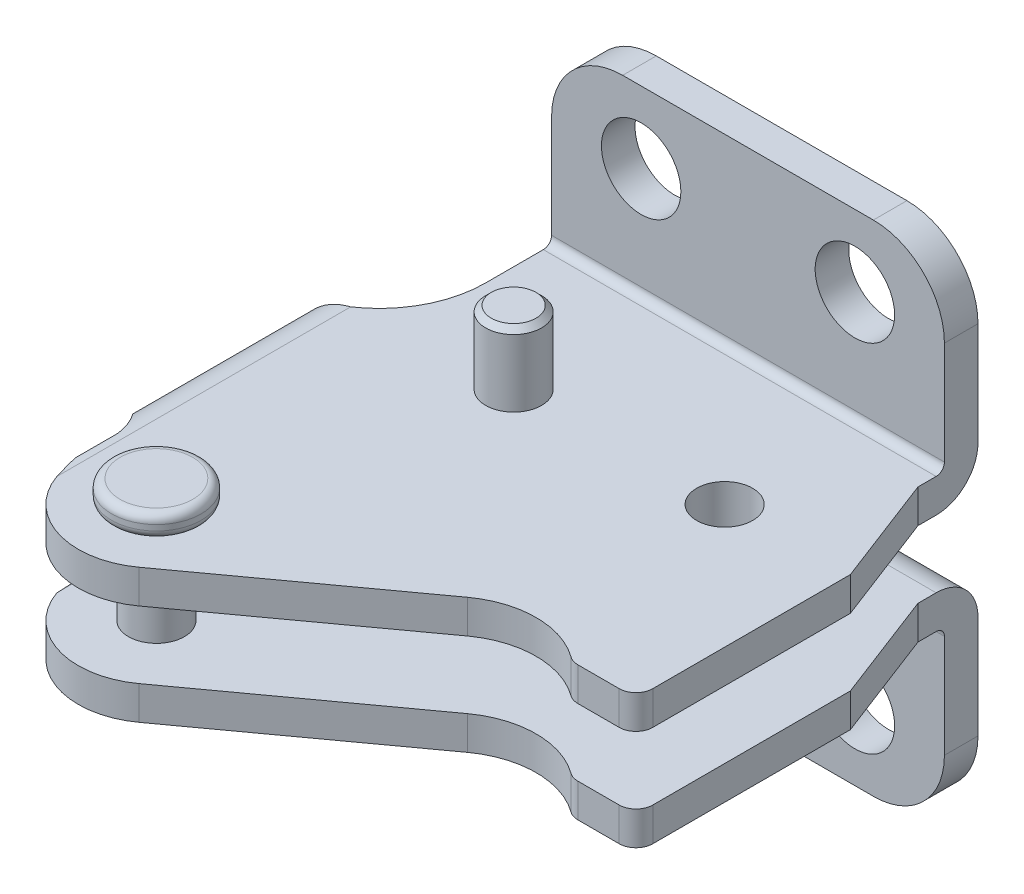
ISO-10303-21;
HEADER;
FILE_DESCRIPTION(('STEP AP214'),'2;1');
FILE_NAME('part.step','',(''),(''),'','','');
FILE_SCHEMA(('AUTOMOTIVE_DESIGN { 1 0 10303 214 1 1 1 1 }'));
ENDSEC;
DATA;
#1=APPLICATION_CONTEXT('core data for automotive mechanical design processes');
#2=APPLICATION_PROTOCOL_DEFINITION('international standard','automotive_design',2000,#1);
#3=PRODUCT_CONTEXT('',#1,'mechanical');
#4=PRODUCT('Part','Part','',(#3));
#5=PRODUCT_RELATED_PRODUCT_CATEGORY('part','',(#4));
#6=PRODUCT_DEFINITION_FORMATION('','',#4);
#7=PRODUCT_DEFINITION_CONTEXT('part definition',#1,'design');
#8=PRODUCT_DEFINITION('design','',#6,#7);
#9=PRODUCT_DEFINITION_SHAPE('','',#8);
#10=(LENGTH_UNIT() NAMED_UNIT(*) SI_UNIT(.MILLI.,.METRE.));
#11=(NAMED_UNIT(*) PLANE_ANGLE_UNIT() SI_UNIT($,.RADIAN.));
#12=(NAMED_UNIT(*) SI_UNIT($,.STERADIAN.) SOLID_ANGLE_UNIT());
#13=UNCERTAINTY_MEASURE_WITH_UNIT(LENGTH_MEASURE(1.E-05),#10,'distance_accuracy_value','');
#14=(GEOMETRIC_REPRESENTATION_CONTEXT(3) GLOBAL_UNCERTAINTY_ASSIGNED_CONTEXT((#13)) GLOBAL_UNIT_ASSIGNED_CONTEXT((#10,
#11,#12)) REPRESENTATION_CONTEXT('',''));
#15=CARTESIAN_POINT('',(0.,0.,0.));
#16=DIRECTION('',(0.,0.,1.));
#17=DIRECTION('',(1.,0.,0.));
#18=AXIS2_PLACEMENT_3D('',#15,#16,#17);
#19=CARTESIAN_POINT('',(19.8127525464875,9.89570811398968,15.3516081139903));
#20=DIRECTION('',(0.,1.,0.));
#21=DIRECTION('',(-1.,0.,0.));
#22=AXIS2_PLACEMENT_3D('',#19,#20,#21);
#23=CYLINDRICAL_SURFACE('',#22,2.5);
#24=CARTESIAN_POINT('',(19.8127525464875,9.89570811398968,15.3516081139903));
#25=DIRECTION('',(0.,-1.,0.));
#26=DIRECTION('',(1.,0.,0.));
#27=AXIS2_PLACEMENT_3D('',#24,#25,#26);
#28=CIRCLE('',#27,2.5);
#29=CARTESIAN_POINT('',(22.3127525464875,9.89570811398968,15.3516081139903));
#30=VERTEX_POINT('',#29);
#31=EDGE_CURVE('E2635',#30,#30,#28,.T.);
#32=ORIENTED_EDGE('',*,*,#31,.T.);
#33=EDGE_LOOP('',(#32));
#34=FACE_BOUND('',#33,.T.);
#35=CARTESIAN_POINT('',(19.8127525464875,21.9001154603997,15.3516081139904));
#36=DIRECTION('',(0.,1.,0.));
#37=DIRECTION('',(-1.,0.,0.));
#38=AXIS2_PLACEMENT_3D('',#35,#36,#37);
#39=CIRCLE('',#38,2.5);
#40=CARTESIAN_POINT('',(17.3127525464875,21.9001154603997,15.3516081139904));
#41=VERTEX_POINT('',#40);
#42=EDGE_CURVE('E18',#41,#41,#39,.F.);
#43=ORIENTED_EDGE('',*,*,#42,.F.);
#44=EDGE_LOOP('',(#43));
#45=FACE_BOUND('',#44,.T.);
#46=ADVANCED_FACE('F14',(#34,#45),#23,.F.);
#47=CARTESIAN_POINT('',(19.8127525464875,9.89570811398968,15.3516081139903));
#48=DIRECTION('',(0.,-1.,0.));
#49=DIRECTION('',(1.,0.,0.));
#50=AXIS2_PLACEMENT_3D('',#47,#48,#49);
#51=PLANE('',#50);
#52=ORIENTED_EDGE('',*,*,#31,.F.);
#53=EDGE_LOOP('',(#52));
#54=FACE_BOUND('',#53,.T.);
#55=CARTESIAN_POINT('',(-5.58724745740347,9.8957081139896,40.7239069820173));
#56=DIRECTION('',(0.,1.,0.));
#57=DIRECTION('',(-1.,0.,0.));
#58=AXIS2_PLACEMENT_3D('',#55,#56,#57);
#59=CIRCLE('',#58,3.33118863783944);
#60=CARTESIAN_POINT('',(-8.91843609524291,9.8957081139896,40.7239069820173));
#61=VERTEX_POINT('',#60);
#62=EDGE_CURVE('E1587',#61,#61,#59,.F.);
#63=ORIENTED_EDGE('',*,*,#62,.F.);
#64=EDGE_LOOP('',(#63));
#65=FACE_BOUND('',#64,.T.);
#66=DIRECTION('',(0.,0.,1.));
#67=VECTOR('',#66,1.);
#68=CARTESIAN_POINT('',(-8.,9.89570811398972,8.9081006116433));
#69=LINE('',#68,#67);
#70=CARTESIAN_POINT('',(-8.,9.89570811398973,3.74));
#71=VERTEX_POINT('',#70);
#72=CARTESIAN_POINT('',(-8.,9.89570811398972,8.90810061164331));
#73=VERTEX_POINT('',#72);
#74=EDGE_CURVE('E431',#71,#73,#69,.T.);
#75=ORIENTED_EDGE('',*,*,#74,.F.);
#76=DIRECTION('',(1.,0.,0.));
#77=VECTOR('',#76,1.);
#78=CARTESIAN_POINT('',(-56.3940156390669,9.89570811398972,3.74));
#79=LINE('',#78,#77);
#80=CARTESIAN_POINT('',(27.1,9.89570811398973,3.74));
#81=VERTEX_POINT('',#80);
#82=EDGE_CURVE('E38',#71,#81,#79,.T.);
#83=ORIENTED_EDGE('',*,*,#82,.T.);
#84=DIRECTION('',(0.,0.,-1.));
#85=VECTOR('',#84,1.);
#86=CARTESIAN_POINT('',(27.1,9.89570811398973,5.36570811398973));
#87=LINE('',#86,#85);
#88=CARTESIAN_POINT('',(27.1,9.89570811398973,5.36570811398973));
#89=VERTEX_POINT('',#88);
#90=EDGE_CURVE('E430',#89,#81,#87,.T.);
#91=ORIENTED_EDGE('',*,*,#90,.F.);
#92=DIRECTION('',(-0.358347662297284,0.,-0.93358821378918));
#93=VECTOR('',#92,1.);
#94=CARTESIAN_POINT('',(30.8617525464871,9.89570811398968,15.1660450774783));
#95=LINE('',#94,#93);
#96=CARTESIAN_POINT('',(30.8617525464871,9.89570811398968,15.1660450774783));
#97=VERTEX_POINT('',#96);
#98=EDGE_CURVE('E428',#97,#89,#95,.T.);
#99=ORIENTED_EDGE('',*,*,#98,.F.);
#100=DIRECTION('',(0.,0.,-1.));
#101=VECTOR('',#100,1.);
#102=CARTESIAN_POINT('',(30.8617525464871,9.89570811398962,32.821906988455));
#103=LINE('',#102,#101);
#104=CARTESIAN_POINT('',(30.8617525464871,9.89570811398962,32.821906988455));
#105=VERTEX_POINT('',#104);
#106=EDGE_CURVE('E794',#105,#97,#103,.T.);
#107=ORIENTED_EDGE('',*,*,#106,.F.);
#108=CARTESIAN_POINT('',(29.3617525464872,9.89570811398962,32.821906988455));
#109=DIRECTION('',(0.,1.,0.));
#110=DIRECTION('',(-1.,0.,0.));
#111=AXIS2_PLACEMENT_3D('',#108,#109,#110);
#112=CIRCLE('',#111,1.49999999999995);
#113=CARTESIAN_POINT('',(29.3617525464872,9.89570811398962,34.3219069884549));
#114=VERTEX_POINT('',#113);
#115=EDGE_CURVE('E607',#114,#105,#112,.T.);
#116=ORIENTED_EDGE('',*,*,#115,.F.);
#117=DIRECTION('',(1.,0.,0.));
#118=VECTOR('',#117,1.);
#119=CARTESIAN_POINT('',(29.3617525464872,9.89570811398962,34.3219069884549));
#120=LINE('',#119,#118);
#121=CARTESIAN_POINT('',(25.6586883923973,9.89570811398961,34.3219069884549));
#122=VERTEX_POINT('',#121);
#123=EDGE_CURVE('E713',#122,#114,#120,.T.);
#124=ORIENTED_EDGE('',*,*,#123,.F.);
#125=CARTESIAN_POINT('',(25.6586883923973,9.89570811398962,32.821906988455));
#126=DIRECTION('',(0.,1.,0.));
#127=DIRECTION('',(-1.,0.,0.));
#128=AXIS2_PLACEMENT_3D('',#125,#126,#127);
#129=CIRCLE('',#128,1.49999999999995);
#130=CARTESIAN_POINT('',(24.7755449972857,9.89570811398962,34.0343663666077));
#131=VERTEX_POINT('',#130);
#132=EDGE_CURVE('E666',#131,#122,#129,.T.);
#133=ORIENTED_EDGE('',*,*,#132,.F.);
#134=CARTESIAN_POINT('',(20.1396309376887,9.89570811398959,40.3989697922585));
#135=DIRECTION('',(0.,-1.,0.));
#136=DIRECTION('',(-1.,0.,0.));
#137=AXIS2_PLACEMENT_3D('',#134,#135,#136);
#138=CIRCLE('',#137,7.8739999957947);
#139=CARTESIAN_POINT('',(15.5114098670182,9.89570811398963,34.0287699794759));
#140=VERTEX_POINT('',#139);
#141=EDGE_CURVE('E667',#140,#131,#138,.T.);
#142=ORIENTED_EDGE('',*,*,#141,.F.);
#143=DIRECTION('',(0.809016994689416,0.,-0.587785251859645));
#144=VECTOR('',#143,1.);
#145=CARTESIAN_POINT('',(-1.48156747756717,9.89570811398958,46.3748906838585));
#146=LINE('',#145,#144);
#147=CARTESIAN_POINT('',(-1.48156747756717,9.89570811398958,46.3748906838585));
#148=VERTEX_POINT('',#147);
#149=EDGE_CURVE('E504',#148,#140,#146,.T.);
#150=ORIENTED_EDGE('',*,*,#149,.F.);
#151=CARTESIAN_POINT('',(-5.58724745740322,9.8957081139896,40.7239069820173));
#152=DIRECTION('',(0.,1.,0.));
#153=DIRECTION('',(-1.,0.,0.));
#154=AXIS2_PLACEMENT_3D('',#151,#152,#153);
#155=CIRCLE('',#154,6.98499999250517);
#156=CARTESIAN_POINT('',(-12.1784589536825,9.89570811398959,43.0360825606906));
#157=VERTEX_POINT('',#156);
#158=EDGE_CURVE('E420',#157,#148,#155,.T.);
#159=ORIENTED_EDGE('',*,*,#158,.F.);
#160=DIRECTION('',(0.,0.,1.));
#161=VECTOR('',#160,1.);
#162=CARTESIAN_POINT('',(-12.1784589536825,9.89570811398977,-8.98429188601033));
#163=LINE('',#162,#161);
#164=CARTESIAN_POINT('',(-12.1784589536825,9.89570811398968,16.7778699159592));
#165=VERTEX_POINT('',#164);
#166=EDGE_CURVE('E673',#165,#157,#163,.T.);
#167=ORIENTED_EDGE('',*,*,#166,.F.);
#168=CARTESIAN_POINT('',(-17.500247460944,9.89570811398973,8.9081006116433));
#169=DIRECTION('',(0.,-1.,0.));
#170=DIRECTION('',(-1.,0.,0.));
#171=AXIS2_PLACEMENT_3D('',#168,#169,#170);
#172=CIRCLE('',#171,9.50024746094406);
#173=EDGE_CURVE('E338',#73,#165,#172,.T.);
#174=ORIENTED_EDGE('',*,*,#173,.F.);
#175=EDGE_LOOP('',(#75,#83,#91,#99,#107,#116,#124,#133,#142,#150,#159,#167,#174));
#176=FACE_BOUND('',#175,.T.);
#177=CARTESIAN_POINT('',(1.48115474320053,9.89570811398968,15.8739069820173));
#178=DIRECTION('',(0.,1.,0.));
#179=DIRECTION('',(-1.,0.,0.));
#180=AXIS2_PLACEMENT_3D('',#177,#178,#179);
#181=CIRCLE('',#180,2.5);
#182=CARTESIAN_POINT('',(-1.01884525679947,9.89570811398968,15.8739069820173));
#183=VERTEX_POINT('',#182);
#184=EDGE_CURVE('E2637',#183,#183,#181,.F.);
#185=ORIENTED_EDGE('',*,*,#184,.F.);
#186=EDGE_LOOP('',(#185));
#187=FACE_BOUND('',#186,.T.);
#188=ADVANCED_FACE('F1473',(#54,#65,#176,#187),#51,.T.);
#189=CARTESIAN_POINT('',(19.8127525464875,9.89570811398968,15.3516081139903));
#190=DIRECTION('',(0.,1.,0.));
#191=DIRECTION('',(-1.,0.,0.));
#192=AXIS2_PLACEMENT_3D('',#189,#190,#191);
#193=CYLINDRICAL_SURFACE('',#192,4.);
#194=CARTESIAN_POINT('',(19.8127525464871,18.9001154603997,15.3516081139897));
#195=DIRECTION('',(0.,-1.,0.));
#196=DIRECTION('',(1.,0.,0.));
#197=AXIS2_PLACEMENT_3D('',#194,#195,#196);
#198=CIRCLE('',#197,4.);
#199=CARTESIAN_POINT('',(23.8127525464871,18.9001154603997,15.3516081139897));
#200=VERTEX_POINT('',#199);
#201=EDGE_CURVE('E9',#200,#200,#198,.T.);
#202=ORIENTED_EDGE('',*,*,#201,.T.);
#203=EDGE_LOOP('',(#202));
#204=FACE_BOUND('',#203,.T.);
#205=CARTESIAN_POINT('',(19.8127525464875,12.8957081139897,15.3516081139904));
#206=DIRECTION('',(0.,1.,0.));
#207=DIRECTION('',(-1.,0.,0.));
#208=AXIS2_PLACEMENT_3D('',#205,#206,#207);
#209=CIRCLE('',#208,4.);
#210=CARTESIAN_POINT('',(15.8127525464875,12.8957081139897,15.3516081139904));
#211=VERTEX_POINT('',#210);
#212=EDGE_CURVE('E24',#211,#211,#209,.F.);
#213=ORIENTED_EDGE('',*,*,#212,.F.);
#214=EDGE_LOOP('',(#213));
#215=FACE_BOUND('',#214,.T.);
#216=ADVANCED_FACE('F1480',(#204,#215),#193,.T.);
#217=CARTESIAN_POINT('',(-5.58724745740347,23.9001154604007,40.7239069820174));
#218=DIRECTION('',(0.,-1.,0.));
#219=DIRECTION('',(0.978336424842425,0.,-0.207021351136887));
#220=AXIS2_PLACEMENT_3D('',#217,#218,#219);
#221=PLANE('',#220);
#222=CARTESIAN_POINT('',(-5.58724745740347,23.9001154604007,40.7239069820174));
#223=DIRECTION('',(0.,1.,0.));
#224=DIRECTION('',(0.978336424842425,0.,-0.207021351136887));
#225=AXIS2_PLACEMENT_3D('',#222,#223,#224);
#226=CIRCLE('',#225,3.25);
#227=CARTESIAN_POINT('',(-2.40765407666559,23.9001154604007,40.0510875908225));
#228=VERTEX_POINT('',#227);
#229=EDGE_CURVE('E1577',#228,#228,#226,.T.);
#230=ORIENTED_EDGE('',*,*,#229,.T.);
#231=EDGE_LOOP('',(#230));
#232=FACE_BOUND('',#231,.T.);
#233=ADVANCED_FACE('F1483',(#232),#221,.F.);
#234=CARTESIAN_POINT('',(-5.58724745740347,7.90011546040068,40.7239069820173));
#235=DIRECTION('',(0.,-1.,0.));
#236=DIRECTION('',(0.978336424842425,0.,-0.207021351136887));
#237=AXIS2_PLACEMENT_3D('',#234,#235,#236);
#238=PLANE('',#237);
#239=CARTESIAN_POINT('',(-5.58724745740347,7.90011546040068,40.7239069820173));
#240=DIRECTION('',(0.,-1.,0.));
#241=DIRECTION('',(0.978336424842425,0.,-0.207021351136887));
#242=AXIS2_PLACEMENT_3D('',#239,#240,#241);
#243=CIRCLE('',#242,3.25);
#244=CARTESIAN_POINT('',(-2.40765407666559,7.90011546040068,40.0510875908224));
#245=VERTEX_POINT('',#244);
#246=EDGE_CURVE('E561',#245,#245,#243,.T.);
#247=ORIENTED_EDGE('',*,*,#246,.T.);
#248=EDGE_LOOP('',(#247));
#249=FACE_BOUND('',#248,.T.);
#250=ADVANCED_FACE('F1508',(#249),#238,.T.);
#251=CARTESIAN_POINT('',(1.48115474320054,28.4001154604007,15.8739069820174));
#252=DIRECTION('',(0.,-1.,0.));
#253=DIRECTION('',(1.,0.,0.));
#254=AXIS2_PLACEMENT_3D('',#251,#252,#253);
#255=PLANE('',#254);
#256=CARTESIAN_POINT('',(1.48115474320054,28.4001154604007,15.8739069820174));
#257=DIRECTION('',(0.,1.,0.));
#258=DIRECTION('',(1.,0.,0.));
#259=AXIS2_PLACEMENT_3D('',#256,#257,#258);
#260=CIRCLE('',#259,2.);
#261=CARTESIAN_POINT('',(3.48115474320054,28.4001154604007,15.8739069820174));
#262=VERTEX_POINT('',#261);
#263=EDGE_CURVE('E1590',#262,#262,#260,.T.);
#264=ORIENTED_EDGE('',*,*,#263,.T.);
#265=EDGE_LOOP('',(#264));
#266=FACE_BOUND('',#265,.T.);
#267=ADVANCED_FACE('F1505',(#266),#255,.F.);
#268=CARTESIAN_POINT('',(1.59594559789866E-13,31.7958235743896,-9.00440734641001));
#269=DIRECTION('',(0.,0.,-1.));
#270=DIRECTION('',(1.,0.,0.));
#271=AXIS2_PLACEMENT_3D('',#268,#269,#270);
#272=CYLINDRICAL_SURFACE('',#271,3.55);
#273=CARTESIAN_POINT('',(1.11022302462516E-13,31.7958235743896,1.11889664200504E-13));
#274=DIRECTION('',(0.,0.,-1.));
#275=DIRECTION('',(1.,0.,0.));
#276=AXIS2_PLACEMENT_3D('',#273,#274,#275);
#277=CIRCLE('',#276,3.55);
#278=CARTESIAN_POINT('',(3.55000000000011,31.7958235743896,1.11889664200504E-13));
#279=VERTEX_POINT('',#278);
#280=EDGE_CURVE('E661',#279,#279,#277,.T.);
#281=ORIENTED_EDGE('',*,*,#280,.T.);
#282=EDGE_LOOP('',(#281));
#283=FACE_BOUND('',#282,.T.);
#284=CARTESIAN_POINT('',(0.,31.7958235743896,3.00000000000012));
#285=DIRECTION('',(0.,0.,-1.));
#286=DIRECTION('',(1.,0.,0.));
#287=AXIS2_PLACEMENT_3D('',#284,#285,#286);
#288=CIRCLE('',#287,3.55);
#289=CARTESIAN_POINT('',(3.55000000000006,31.7958235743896,3.00000000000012));
#290=VERTEX_POINT('',#289);
#291=EDGE_CURVE('E761',#290,#290,#288,.T.);
#292=ORIENTED_EDGE('',*,*,#291,.F.);
#293=EDGE_LOOP('',(#292));
#294=FACE_BOUND('',#293,.T.);
#295=ADVANCED_FACE('F998',(#283,#294),#272,.F.);
#296=CARTESIAN_POINT('',(19.1,31.7958235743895,-9.00440734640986));
#297=DIRECTION('',(0.,0.,-1.));
#298=DIRECTION('',(1.,0.,0.));
#299=AXIS2_PLACEMENT_3D('',#296,#297,#298);
#300=CYLINDRICAL_SURFACE('',#299,3.55);
#301=CARTESIAN_POINT('',(19.1,31.7958235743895,1.11889664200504E-13));
#302=DIRECTION('',(0.,0.,-1.));
#303=DIRECTION('',(1.,0.,0.));
#304=AXIS2_PLACEMENT_3D('',#301,#302,#303);
#305=CIRCLE('',#304,3.55);
#306=CARTESIAN_POINT('',(22.65,31.7958235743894,1.11889664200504E-13));
#307=VERTEX_POINT('',#306);
#308=EDGE_CURVE('E656',#307,#307,#305,.T.);
#309=ORIENTED_EDGE('',*,*,#308,.T.);
#310=EDGE_LOOP('',(#309));
#311=FACE_BOUND('',#310,.T.);
#312=CARTESIAN_POINT('',(19.1,31.7958235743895,3.00000000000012));
#313=DIRECTION('',(0.,0.,-1.));
#314=DIRECTION('',(1.,0.,0.));
#315=AXIS2_PLACEMENT_3D('',#312,#313,#314);
#316=CIRCLE('',#315,3.55);
#317=CARTESIAN_POINT('',(22.65,31.7958235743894,3.00000000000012));
#318=VERTEX_POINT('',#317);
#319=EDGE_CURVE('E463',#318,#318,#316,.T.);
#320=ORIENTED_EDGE('',*,*,#319,.F.);
#321=EDGE_LOOP('',(#320));
#322=FACE_BOUND('',#321,.T.);
#323=ADVANCED_FACE('F1824',(#311,#322),#300,.F.);
#324=CARTESIAN_POINT('',(-8.00049492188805,13.9534310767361,0.));
#325=DIRECTION('',(1.,0.,0.));
#326=DIRECTION('',(0.,1.,0.));
#327=AXIS2_PLACEMENT_3D('',#324,#325,#326);
#328=PLANE('',#327);
#329=DIRECTION('',(0.,1.,0.));
#330=VECTOR('',#329,1.);
#331=CARTESIAN_POINT('',(-8.00049492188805,13.9534310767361,0.));
#332=LINE('',#331,#330);
#333=CARTESIAN_POINT('',(-8.00049492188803,22.6401154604,0.));
#334=VERTEX_POINT('',#333);
#335=CARTESIAN_POINT('',(-8.00049492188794,31.8458235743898,1.11889664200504E-13));
#336=VERTEX_POINT('',#335);
#337=EDGE_CURVE('E580',#334,#336,#332,.T.);
#338=ORIENTED_EDGE('',*,*,#337,.F.);
#339=CARTESIAN_POINT('',(-8.00049492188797,22.6401154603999,3.74000000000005));
#340=DIRECTION('',(1.,0.,0.));
#341=DIRECTION('',(0.,1.,0.));
#342=AXIS2_PLACEMENT_3D('',#339,#340,#341);
#343=CIRCLE('',#342,3.74);
#344=CARTESIAN_POINT('',(-8.00049492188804,18.9001154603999,3.74));
#345=VERTEX_POINT('',#344);
#346=EDGE_CURVE('E472',#345,#334,#343,.T.);
#347=ORIENTED_EDGE('',*,*,#346,.F.);
#348=DIRECTION('',(0.,0.,-1.));
#349=VECTOR('',#348,1.);
#350=CARTESIAN_POINT('',(-8.00049492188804,18.9001154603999,8.90810061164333));
#351=LINE('',#350,#349);
#352=CARTESIAN_POINT('',(-8.00049492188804,18.9001154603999,8.90810061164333));
#353=VERTEX_POINT('',#352);
#354=EDGE_CURVE('E785',#353,#345,#351,.T.);
#355=ORIENTED_EDGE('',*,*,#354,.F.);
#356=DIRECTION('',(0.,1.,0.));
#357=VECTOR('',#356,1.);
#358=CARTESIAN_POINT('',(-8.00049492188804,18.9001154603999,8.90810061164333));
#359=LINE('',#358,#357);
#360=CARTESIAN_POINT('',(-8.00049492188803,21.9001154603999,8.90810061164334));
#361=VERTEX_POINT('',#360);
#362=EDGE_CURVE('E448',#353,#361,#359,.T.);
#363=ORIENTED_EDGE('',*,*,#362,.T.);
#364=DIRECTION('',(0.,0.,-1.));
#365=VECTOR('',#364,1.);
#366=CARTESIAN_POINT('',(-8.00049492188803,21.9001154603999,8.90810061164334));
#367=LINE('',#366,#365);
#368=CARTESIAN_POINT('',(-8.00049492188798,21.9001154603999,3.74000000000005));
#369=VERTEX_POINT('',#368);
#370=EDGE_CURVE('E452',#361,#369,#367,.T.);
#371=ORIENTED_EDGE('',*,*,#370,.T.);
#372=CARTESIAN_POINT('',(-8.00049492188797,22.6401154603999,3.74000000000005));
#373=DIRECTION('',(1.,0.,0.));
#374=DIRECTION('',(0.,1.,0.));
#375=AXIS2_PLACEMENT_3D('',#372,#373,#374);
#376=CIRCLE('',#375,0.74);
#377=CARTESIAN_POINT('',(-8.00049492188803,22.6401154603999,3.00000000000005));
#378=VERTEX_POINT('',#377);
#379=EDGE_CURVE('E618',#369,#378,#376,.T.);
#380=ORIENTED_EDGE('',*,*,#379,.T.);
#381=DIRECTION('',(0.,1.,0.));
#382=VECTOR('',#381,1.);
#383=CARTESIAN_POINT('',(-8.00049492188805,13.953431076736,3.));
#384=LINE('',#383,#382);
#385=CARTESIAN_POINT('',(-8.00049492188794,31.8458235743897,3.00000000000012));
#386=VERTEX_POINT('',#385);
#387=EDGE_CURVE('E458',#378,#386,#384,.T.);
#388=ORIENTED_EDGE('',*,*,#387,.T.);
#389=DIRECTION('',(0.,0.,1.));
#390=VECTOR('',#389,1.);
#391=CARTESIAN_POINT('',(-8.00049492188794,31.8458235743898,1.11889664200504E-13));
#392=LINE('',#391,#390);
#393=EDGE_CURVE('E567',#336,#386,#392,.T.);
#394=ORIENTED_EDGE('',*,*,#393,.F.);
#395=EDGE_LOOP('',(#338,#347,#355,#363,#371,#380,#388,#394));
#396=FACE_BOUND('',#395,.T.);
#397=ADVANCED_FACE('F1151',(#396),#328,.F.);
#398=CARTESIAN_POINT('',(-1.65049492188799,31.8458235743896,1.11889664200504E-13));
#399=DIRECTION('',(0.,0.,1.));
#400=DIRECTION('',(-1.,0.,0.));
#401=AXIS2_PLACEMENT_3D('',#398,#399,#400);
#402=CYLINDRICAL_SURFACE('',#401,6.35);
#403=CARTESIAN_POINT('',(-1.65049492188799,31.8458235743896,3.00000000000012));
#404=DIRECTION('',(0.,0.,-1.));
#405=DIRECTION('',(1.,0.,0.));
#406=AXIS2_PLACEMENT_3D('',#403,#404,#405);
#407=CIRCLE('',#406,6.35);
#408=CARTESIAN_POINT('',(-1.65049492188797,38.1958235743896,3.00000000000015));
#409=VERTEX_POINT('',#408);
#410=EDGE_CURVE('E446',#386,#409,#407,.T.);
#411=ORIENTED_EDGE('',*,*,#410,.T.);
#412=DIRECTION('',(0.,0.,1.));
#413=VECTOR('',#412,1.);
#414=CARTESIAN_POINT('',(-1.65049492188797,38.1958235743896,1.54390389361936E-13));
#415=LINE('',#414,#413);
#416=CARTESIAN_POINT('',(-1.65049492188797,38.1958235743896,1.54390389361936E-13));
#417=VERTEX_POINT('',#416);
#418=EDGE_CURVE('E487',#417,#409,#415,.T.);
#419=ORIENTED_EDGE('',*,*,#418,.F.);
#420=CARTESIAN_POINT('',(-1.65049492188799,31.8458235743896,1.11889664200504E-13));
#421=DIRECTION('',(0.,0.,-1.));
#422=DIRECTION('',(1.,0.,0.));
#423=AXIS2_PLACEMENT_3D('',#420,#421,#422);
#424=CIRCLE('',#423,6.35);
#425=EDGE_CURVE('E681',#336,#417,#424,.T.);
#426=ORIENTED_EDGE('',*,*,#425,.F.);
#427=ORIENTED_EDGE('',*,*,#393,.T.);
#428=EDGE_LOOP('',(#411,#419,#426,#427));
#429=FACE_BOUND('',#428,.T.);
#430=ADVANCED_FACE('F2422',(#429),#402,.T.);
#431=CARTESIAN_POINT('',(-1.65049492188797,38.1958235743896,1.54390389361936E-13));
#432=DIRECTION('',(0.,-1.,0.));
#433=DIRECTION('',(0.,0.,1.));
#434=AXIS2_PLACEMENT_3D('',#431,#432,#433);
#435=PLANE('',#434);
#436=DIRECTION('',(1.,0.,0.));
#437=VECTOR('',#436,1.);
#438=CARTESIAN_POINT('',(-1.65049492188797,38.1958235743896,3.00000000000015));
#439=LINE('',#438,#437);
#440=CARTESIAN_POINT('',(20.7495050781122,38.1958235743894,3.00000000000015));
#441=VERTEX_POINT('',#440);
#442=EDGE_CURVE('E490',#409,#441,#439,.T.);
#443=ORIENTED_EDGE('',*,*,#442,.T.);
#444=DIRECTION('',(0.,0.,1.));
#445=VECTOR('',#444,1.);
#446=CARTESIAN_POINT('',(20.7495050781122,38.1958235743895,1.54390389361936E-13));
#447=LINE('',#446,#445);
#448=CARTESIAN_POINT('',(20.7495050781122,38.1958235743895,1.54390389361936E-13));
#449=VERTEX_POINT('',#448);
#450=EDGE_CURVE('E645',#449,#441,#447,.T.);
#451=ORIENTED_EDGE('',*,*,#450,.F.);
#452=DIRECTION('',(1.,0.,0.));
#453=VECTOR('',#452,1.);
#454=CARTESIAN_POINT('',(-1.65049492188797,38.1958235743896,1.54390389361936E-13));
#455=LINE('',#454,#453);
#456=EDGE_CURVE('E704',#417,#449,#455,.T.);
#457=ORIENTED_EDGE('',*,*,#456,.F.);
#458=ORIENTED_EDGE('',*,*,#418,.T.);
#459=EDGE_LOOP('',(#443,#451,#457,#458));
#460=FACE_BOUND('',#459,.T.);
#461=ADVANCED_FACE('F1669',(#460),#435,.F.);
#462=CARTESIAN_POINT('',(20.7495050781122,31.8458235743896,1.11889664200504E-13));
#463=DIRECTION('',(0.,0.,1.));
#464=DIRECTION('',(-1.,0.,0.));
#465=AXIS2_PLACEMENT_3D('',#462,#463,#464);
#466=CYLINDRICAL_SURFACE('',#465,6.35);
#467=CARTESIAN_POINT('',(20.7495050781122,31.8458235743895,3.00000000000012));
#468=DIRECTION('',(0.,0.,-1.));
#469=DIRECTION('',(1.,0.,0.));
#470=AXIS2_PLACEMENT_3D('',#467,#468,#469);
#471=CIRCLE('',#470,6.34999999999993);
#472=CARTESIAN_POINT('',(27.0995050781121,31.8458235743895,3.00000000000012));
#473=VERTEX_POINT('',#472);
#474=EDGE_CURVE('E640',#441,#473,#471,.T.);
#475=ORIENTED_EDGE('',*,*,#474,.T.);
#476=DIRECTION('',(0.,0.,1.));
#477=VECTOR('',#476,1.);
#478=CARTESIAN_POINT('',(27.0995050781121,31.8458235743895,1.11889664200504E-13));
#479=LINE('',#478,#477);
#480=CARTESIAN_POINT('',(27.0995050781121,31.8458235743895,1.11889664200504E-13));
#481=VERTEX_POINT('',#480);
#482=EDGE_CURVE('E627',#481,#473,#479,.T.);
#483=ORIENTED_EDGE('',*,*,#482,.F.);
#484=CARTESIAN_POINT('',(20.7495050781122,31.8458235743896,1.11889664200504E-13));
#485=DIRECTION('',(0.,0.,-1.));
#486=DIRECTION('',(1.,0.,0.));
#487=AXIS2_PLACEMENT_3D('',#484,#485,#486);
#488=CIRCLE('',#487,6.35);
#489=EDGE_CURVE('E462',#449,#481,#488,.T.);
#490=ORIENTED_EDGE('',*,*,#489,.F.);
#491=ORIENTED_EDGE('',*,*,#450,.T.);
#492=EDGE_LOOP('',(#475,#483,#490,#491));
#493=FACE_BOUND('',#492,.T.);
#494=ADVANCED_FACE('F1666',(#493),#466,.T.);
#495=CARTESIAN_POINT('',(27.099505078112,17.4958235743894,0.));
#496=DIRECTION('',(-1.,0.,0.));
#497=DIRECTION('',(0.,0.,-1.));
#498=AXIS2_PLACEMENT_3D('',#495,#496,#497);
#499=PLANE('',#498);
#500=DIRECTION('',(0.,-1.,0.));
#501=VECTOR('',#500,1.);
#502=CARTESIAN_POINT('',(27.099505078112,17.4958235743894,3.));
#503=LINE('',#502,#501);
#504=CARTESIAN_POINT('',(27.0995050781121,22.6401154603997,3.00000000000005));
#505=VERTEX_POINT('',#504);
#506=EDGE_CURVE('E623',#473,#505,#503,.T.);
#507=ORIENTED_EDGE('',*,*,#506,.T.);
#508=CARTESIAN_POINT('',(27.0995050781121,22.6401154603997,3.74000000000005));
#509=DIRECTION('',(-1.,0.,0.));
#510=DIRECTION('',(0.,1.,0.));
#511=AXIS2_PLACEMENT_3D('',#508,#509,#510);
#512=CIRCLE('',#511,0.74);
#513=CARTESIAN_POINT('',(27.099505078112,21.9001154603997,3.74000000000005));
#514=VERTEX_POINT('',#513);
#515=EDGE_CURVE('E622',#505,#514,#512,.T.);
#516=ORIENTED_EDGE('',*,*,#515,.T.);
#517=DIRECTION('',(0.,0.,1.));
#518=VECTOR('',#517,1.);
#519=CARTESIAN_POINT('',(27.099505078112,21.9001154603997,5.36570811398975));
#520=LINE('',#519,#518);
#521=CARTESIAN_POINT('',(27.099505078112,21.9001154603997,5.36570811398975));
#522=VERTEX_POINT('',#521);
#523=EDGE_CURVE('E330',#514,#522,#520,.T.);
#524=ORIENTED_EDGE('',*,*,#523,.T.);
#525=DIRECTION('',(0.,1.,0.));
#526=VECTOR('',#525,1.);
#527=CARTESIAN_POINT('',(27.099505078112,18.9001154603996,5.36570811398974));
#528=LINE('',#527,#526);
#529=CARTESIAN_POINT('',(27.099505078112,18.9001154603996,5.36570811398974));
#530=VERTEX_POINT('',#529);
#531=EDGE_CURVE('E542',#530,#522,#528,.T.);
#532=ORIENTED_EDGE('',*,*,#531,.F.);
#533=DIRECTION('',(0.,0.,1.));
#534=VECTOR('',#533,1.);
#535=CARTESIAN_POINT('',(27.099505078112,18.9001154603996,5.36570811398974));
#536=LINE('',#535,#534);
#537=CARTESIAN_POINT('',(27.099505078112,18.9001154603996,3.74));
#538=VERTEX_POINT('',#537);
#539=EDGE_CURVE('E563',#538,#530,#536,.T.);
#540=ORIENTED_EDGE('',*,*,#539,.F.);
#541=CARTESIAN_POINT('',(27.0995050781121,22.6401154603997,3.74000000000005));
#542=DIRECTION('',(-1.,0.,0.));
#543=DIRECTION('',(0.,-1.,0.));
#544=AXIS2_PLACEMENT_3D('',#541,#542,#543);
#545=CIRCLE('',#544,3.74);
#546=CARTESIAN_POINT('',(27.0995050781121,22.6401154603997,0.));
#547=VERTEX_POINT('',#546);
#548=EDGE_CURVE('E477',#547,#538,#545,.T.);
#549=ORIENTED_EDGE('',*,*,#548,.F.);
#550=DIRECTION('',(0.,-1.,0.));
#551=VECTOR('',#550,1.);
#552=CARTESIAN_POINT('',(27.099505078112,17.4958235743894,0.));
#553=LINE('',#552,#551);
#554=EDGE_CURVE('E571',#481,#547,#553,.T.);
#555=ORIENTED_EDGE('',*,*,#554,.F.);
#556=ORIENTED_EDGE('',*,*,#482,.T.);
#557=EDGE_LOOP('',(#507,#516,#524,#532,#540,#549,#555,#556));
#558=FACE_BOUND('',#557,.T.);
#559=ADVANCED_FACE('F1517',(#558),#499,.F.);
#560=CARTESIAN_POINT('',(-5.58724745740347,23.1501154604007,40.7239069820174));
#561=DIRECTION('',(0.,-1.,0.));
#562=DIRECTION('',(0.978336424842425,0.,-0.207021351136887));
#563=AXIS2_PLACEMENT_3D('',#560,#561,#562);
#564=TOROIDAL_SURFACE('',#563,3.25,0.75);
#565=CARTESIAN_POINT('',(-5.58724745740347,23.1501154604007,40.7239069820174));
#566=DIRECTION('',(0.,-1.,0.));
#567=DIRECTION('',(0.978336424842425,0.,-0.207021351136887));
#568=AXIS2_PLACEMENT_3D('',#565,#566,#567);
#569=CIRCLE('',#568,4.);
#570=CARTESIAN_POINT('',(-1.67390175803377,23.1501154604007,39.8958215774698));
#571=VERTEX_POINT('',#570);
#572=EDGE_CURVE('E1572',#571,#571,#569,.T.);
#573=ORIENTED_EDGE('',*,*,#572,.F.);
#574=EDGE_LOOP('',(#573));
#575=FACE_BOUND('',#574,.T.);
#576=ORIENTED_EDGE('',*,*,#229,.F.);
#577=EDGE_LOOP('',(#576));
#578=FACE_BOUND('',#577,.T.);
#579=ADVANCED_FACE('F1500',(#575,#578),#564,.T.);
#580=CARTESIAN_POINT('',(1.48115474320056,3.40011546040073,15.8739069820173));
#581=DIRECTION('',(0.,-1.,0.));
#582=DIRECTION('',(1.,0.,0.));
#583=AXIS2_PLACEMENT_3D('',#580,#581,#582);
#584=PLANE('',#583);
#585=CARTESIAN_POINT('',(1.48115474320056,3.40011546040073,15.8739069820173));
#586=DIRECTION('',(0.,-1.,0.));
#587=DIRECTION('',(1.,0.,0.));
#588=AXIS2_PLACEMENT_3D('',#585,#586,#587);
#589=CIRCLE('',#588,2.);
#590=CARTESIAN_POINT('',(3.48115474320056,3.40011546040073,15.8739069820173));
#591=VERTEX_POINT('',#590);
#592=EDGE_CURVE('E1593',#591,#591,#589,.T.);
#593=ORIENTED_EDGE('',*,*,#592,.T.);
#594=EDGE_LOOP('',(#593));
#595=FACE_BOUND('',#594,.T.);
#596=ADVANCED_FACE('F1496',(#595),#584,.T.);
#597=CARTESIAN_POINT('',(-12.6784589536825,15.5759039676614,8.90810061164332));
#598=DIRECTION('',(-1.,0.,0.));
#599=DIRECTION('',(0.,-1.,0.));
#600=AXIS2_PLACEMENT_3D('',#597,#598,#599);
#601=CYLINDRICAL_SURFACE('',#600,9.50024746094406);
#602=CARTESIAN_POINT('',(-12.6784589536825,15.5759039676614,8.90810061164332));
#603=DIRECTION('',(-1.,0.,0.));
#604=DIRECTION('',(0.,1.,0.));
#605=AXIS2_PLACEMENT_3D('',#602,#603,#604);
#606=CIRCLE('',#605,9.50024746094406);
#607=CARTESIAN_POINT('',(-12.6784589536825,13.3957081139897,18.1547999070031));
#608=VERTEX_POINT('',#607);
#609=CARTESIAN_POINT('',(-12.6784589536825,15.5759039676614,18.4083480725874));
#610=VERTEX_POINT('',#609);
#611=EDGE_CURVE('E536',#608,#610,#606,.T.);
#612=ORIENTED_EDGE('',*,*,#611,.F.);
#613=CARTESIAN_POINT('',(-12.6784589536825,13.3957081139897,18.1547999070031));
#614=CARTESIAN_POINT('',(-13.6784589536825,13.3957081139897,18.1547999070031));
#615=CARTESIAN_POINT('',(-14.6784589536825,13.3957081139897,18.1547999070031));
#616=CARTESIAN_POINT('',(-15.6784589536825,13.3957081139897,18.1547999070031));
#617=(BOUNDED_CURVE() B_SPLINE_CURVE(3,(#613,#614,#615,#616),.UNSPECIFIED.,.F.,
.F.) B_SPLINE_CURVE_WITH_KNOTS((4,4),(0.,1.),
.UNSPECIFIED.) CURVE() GEOMETRIC_REPRESENTATION_ITEM() RATIONAL_B_SPLINE_CURVE((1.,1.,1.,1.)) REPRESENTATION_ITEM(''));
#618=CARTESIAN_POINT('',(-15.6784589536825,13.3957081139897,18.1547999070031));
#619=VERTEX_POINT('',#618);
#620=EDGE_CURVE('E1756',#608,#619,#617,.T.);
#621=ORIENTED_EDGE('',*,*,#620,.T.);
#622=CARTESIAN_POINT('',(-15.6784589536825,15.5759039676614,8.90810061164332));
#623=DIRECTION('',(-1.,0.,0.));
#624=DIRECTION('',(0.,1.,0.));
#625=AXIS2_PLACEMENT_3D('',#622,#623,#624);
#626=CIRCLE('',#625,9.50024746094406);
#627=CARTESIAN_POINT('',(-15.6784589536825,15.5759039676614,18.4083480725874));
#628=VERTEX_POINT('',#627);
#629=EDGE_CURVE('E1032',#619,#628,#626,.T.);
#630=ORIENTED_EDGE('',*,*,#629,.T.);
#631=DIRECTION('',(-1.,0.,0.));
#632=VECTOR('',#631,1.);
#633=CARTESIAN_POINT('',(-12.6784589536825,15.5759039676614,18.4083480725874));
#634=LINE('',#633,#632);
#635=EDGE_CURVE('E486',#610,#628,#634,.T.);
#636=ORIENTED_EDGE('',*,*,#635,.F.);
#637=EDGE_LOOP('',(#612,#621,#630,#636));
#638=FACE_BOUND('',#637,.T.);
#639=ADVANCED_FACE('F1499',(#638),#601,.F.);
#640=CARTESIAN_POINT('',(-12.6784589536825,15.5759039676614,18.4083480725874));
#641=DIRECTION('',(0.,0.,1.));
#642=DIRECTION('',(0.,1.,0.));
#643=AXIS2_PLACEMENT_3D('',#640,#641,#642);
#644=PLANE('',#643);
#645=DIRECTION('',(0.,1.,0.));
#646=VECTOR('',#645,1.);
#647=CARTESIAN_POINT('',(-15.6784589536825,15.5759039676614,18.4083480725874));
#648=LINE('',#647,#646);
#649=CARTESIAN_POINT('',(-15.6784589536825,16.2194246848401,18.4083480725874));
#650=VERTEX_POINT('',#649);
#651=EDGE_CURVE('E481',#628,#650,#648,.T.);
#652=ORIENTED_EDGE('',*,*,#651,.T.);
#653=DIRECTION('',(-1.,0.,0.));
#654=VECTOR('',#653,1.);
#655=CARTESIAN_POINT('',(-12.6784589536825,16.2194246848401,18.4083480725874));
#656=LINE('',#655,#654);
#657=CARTESIAN_POINT('',(-12.6784589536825,16.2194246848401,18.4083480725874));
#658=VERTEX_POINT('',#657);
#659=EDGE_CURVE('E636',#658,#650,#656,.T.);
#660=ORIENTED_EDGE('',*,*,#659,.F.);
#661=DIRECTION('',(0.,1.,0.));
#662=VECTOR('',#661,1.);
#663=CARTESIAN_POINT('',(-12.6784589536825,15.5759039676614,18.4083480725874));
#664=LINE('',#663,#662);
#665=EDGE_CURVE('E533',#610,#658,#664,.T.);
#666=ORIENTED_EDGE('',*,*,#665,.F.);
#667=ORIENTED_EDGE('',*,*,#635,.T.);
#668=EDGE_LOOP('',(#652,#660,#666,#667));
#669=FACE_BOUND('',#668,.T.);
#670=ADVANCED_FACE('F1818',(#669),#644,.F.);
#671=CARTESIAN_POINT('',(-12.6784589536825,16.2194246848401,8.90810061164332));
#672=DIRECTION('',(-1.,0.,0.));
#673=DIRECTION('',(0.,-1.,0.));
#674=AXIS2_PLACEMENT_3D('',#671,#672,#673);
#675=CYLINDRICAL_SURFACE('',#674,9.50024746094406);
#676=CARTESIAN_POINT('',(-12.6784589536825,18.4001154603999,18.1546831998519));
#677=CARTESIAN_POINT('',(-15.6784589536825,18.4001154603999,18.1546831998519));
#678=(BOUNDED_CURVE() B_SPLINE_CURVE(1,(#676,#677),.UNSPECIFIED.,.F.,
.F.) B_SPLINE_CURVE_WITH_KNOTS((2,2),(0.,1.),
.UNSPECIFIED.) CURVE() GEOMETRIC_REPRESENTATION_ITEM() RATIONAL_B_SPLINE_CURVE((1.,1.)) REPRESENTATION_ITEM(''));
#679=CARTESIAN_POINT('',(-12.6784589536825,18.4001154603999,18.1546831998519));
#680=VERTEX_POINT('',#679);
#681=CARTESIAN_POINT('',(-15.6784589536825,18.4001154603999,18.1546831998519));
#682=VERTEX_POINT('',#681);
#683=EDGE_CURVE('E1617',#680,#682,#678,.T.);
#684=ORIENTED_EDGE('',*,*,#683,.F.);
#685=CARTESIAN_POINT('',(-12.6784589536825,16.2194246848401,8.90810061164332));
#686=DIRECTION('',(-1.,0.,0.));
#687=DIRECTION('',(0.,1.,0.));
#688=AXIS2_PLACEMENT_3D('',#685,#686,#687);
#689=CIRCLE('',#688,9.50024746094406);
#690=EDGE_CURVE('E480',#658,#680,#689,.T.);
#691=ORIENTED_EDGE('',*,*,#690,.F.);
#692=ORIENTED_EDGE('',*,*,#659,.T.);
#693=CARTESIAN_POINT('',(-15.6784589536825,16.2194246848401,8.90810061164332));
#694=DIRECTION('',(-1.,0.,0.));
#695=DIRECTION('',(0.,1.,0.));
#696=AXIS2_PLACEMENT_3D('',#693,#694,#695);
#697=CIRCLE('',#696,9.50024746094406);
#698=EDGE_CURVE('E694',#650,#682,#697,.T.);
#699=ORIENTED_EDGE('',*,*,#698,.T.);
#700=EDGE_LOOP('',(#684,#691,#692,#699));
#701=FACE_BOUND('',#700,.T.);
#702=ADVANCED_FACE('F1281',(#701),#675,.F.);
#703=CARTESIAN_POINT('',(-12.6784589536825,15.8979117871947,36.9308331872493));
#704=DIRECTION('',(-1.,0.,0.));
#705=DIRECTION('',(0.,-1.,0.));
#706=AXIS2_PLACEMENT_3D('',#703,#704,#705);
#707=CYLINDRICAL_SURFACE('',#706,5.25000783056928);
#708=CARTESIAN_POINT('',(-15.6784589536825,18.4001154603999,32.3154719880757));
#709=CARTESIAN_POINT('',(-12.6784589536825,18.4001154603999,32.3154719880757));
#710=(BOUNDED_CURVE() B_SPLINE_CURVE(1,(#708,#709),.UNSPECIFIED.,.F.,
.F.) B_SPLINE_CURVE_WITH_KNOTS((2,2),(0.,1.),
.UNSPECIFIED.) CURVE() GEOMETRIC_REPRESENTATION_ITEM() RATIONAL_B_SPLINE_CURVE((1.,1.)) REPRESENTATION_ITEM(''));
#711=CARTESIAN_POINT('',(-15.6784589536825,18.4001154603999,32.3154719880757));
#712=VERTEX_POINT('',#711);
#713=CARTESIAN_POINT('',(-12.6784589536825,18.4001154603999,32.3154719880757));
#714=VERTEX_POINT('',#713);
#715=EDGE_CURVE('E1247',#712,#714,#710,.T.);
#716=ORIENTED_EDGE('',*,*,#715,.F.);
#717=CARTESIAN_POINT('',(-15.6784589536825,15.8979117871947,36.9308331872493));
#718=DIRECTION('',(-1.,0.,0.));
#719=DIRECTION('',(0.,1.,0.));
#720=AXIS2_PLACEMENT_3D('',#717,#718,#719);
#721=CIRCLE('',#720,5.25000783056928);
#722=CARTESIAN_POINT('',(-15.6784589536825,13.3957081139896,32.3154719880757));
#723=VERTEX_POINT('',#722);
#724=EDGE_CURVE('E1021',#712,#723,#721,.T.);
#725=ORIENTED_EDGE('',*,*,#724,.T.);
#726=CARTESIAN_POINT('',(-15.6784589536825,13.3957081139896,32.3154719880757));
#727=CARTESIAN_POINT('',(-14.6784589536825,13.3957081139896,32.3154719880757));
#728=CARTESIAN_POINT('',(-13.6784589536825,13.3957081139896,32.3154719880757));
#729=CARTESIAN_POINT('',(-12.6784589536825,13.3957081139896,32.3154719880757));
#730=(BOUNDED_CURVE() B_SPLINE_CURVE(3,(#726,#727,#728,#729),.UNSPECIFIED.,.F.,
.F.) B_SPLINE_CURVE_WITH_KNOTS((4,4),(0.,1.),
.UNSPECIFIED.) CURVE() GEOMETRIC_REPRESENTATION_ITEM() RATIONAL_B_SPLINE_CURVE((1.,1.,1.,1.)) REPRESENTATION_ITEM(''));
#731=CARTESIAN_POINT('',(-12.6784589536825,13.3957081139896,32.3154719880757));
#732=VERTEX_POINT('',#731);
#733=EDGE_CURVE('E485',#723,#732,#730,.T.);
#734=ORIENTED_EDGE('',*,*,#733,.T.);
#735=CARTESIAN_POINT('',(-12.6784589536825,15.8979117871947,36.9308331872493));
#736=DIRECTION('',(-1.,0.,0.));
#737=DIRECTION('',(0.,1.,0.));
#738=AXIS2_PLACEMENT_3D('',#735,#736,#737);
#739=CIRCLE('',#738,5.25000783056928);
#740=EDGE_CURVE('E907',#714,#732,#739,.T.);
#741=ORIENTED_EDGE('',*,*,#740,.F.);
#742=EDGE_LOOP('',(#716,#725,#734,#741));
#743=FACE_BOUND('',#742,.T.);
#744=ADVANCED_FACE('F1457',(#743),#707,.F.);
#745=CARTESIAN_POINT('',(19.1,0.,3.));
#746=DIRECTION('',(0.,0.,1.));
#747=DIRECTION('',(1.,0.,0.));
#748=AXIS2_PLACEMENT_3D('',#745,#746,#747);
#749=CYLINDRICAL_SURFACE('',#748,3.55);
#750=CARTESIAN_POINT('',(19.1,0.,3.));
#751=DIRECTION('',(0.,0.,1.));
#752=DIRECTION('',(1.,0.,0.));
#753=AXIS2_PLACEMENT_3D('',#750,#751,#752);
#754=CIRCLE('',#753,3.55);
#755=CARTESIAN_POINT('',(22.65,0.,3.));
#756=VERTEX_POINT('',#755);
#757=EDGE_CURVE('E562',#756,#756,#754,.T.);
#758=ORIENTED_EDGE('',*,*,#757,.T.);
#759=EDGE_LOOP('',(#758));
#760=FACE_BOUND('',#759,.T.);
#761=CARTESIAN_POINT('',(19.1,0.,0.));
#762=DIRECTION('',(0.,0.,-1.));
#763=DIRECTION('',(-1.,0.,0.));
#764=AXIS2_PLACEMENT_3D('',#761,#762,#763);
#765=CIRCLE('',#764,3.55);
#766=CARTESIAN_POINT('',(15.55,0.,0.));
#767=VERTEX_POINT('',#766);
#768=EDGE_CURVE('E557',#767,#767,#765,.T.);
#769=ORIENTED_EDGE('',*,*,#768,.T.);
#770=EDGE_LOOP('',(#769));
#771=FACE_BOUND('',#770,.T.);
#772=ADVANCED_FACE('F1454',(#760,#771),#749,.F.);
#773=CARTESIAN_POINT('',(0.,0.,3.));
#774=DIRECTION('',(0.,0.,1.));
#775=DIRECTION('',(1.,0.,0.));
#776=AXIS2_PLACEMENT_3D('',#773,#774,#775);
#777=CYLINDRICAL_SURFACE('',#776,3.55);
#778=CARTESIAN_POINT('',(0.,0.,3.));
#779=DIRECTION('',(0.,0.,1.));
#780=DIRECTION('',(1.,0.,0.));
#781=AXIS2_PLACEMENT_3D('',#778,#779,#780);
#782=CIRCLE('',#781,3.55);
#783=CARTESIAN_POINT('',(3.55,0.,3.));
#784=VERTEX_POINT('',#783);
#785=EDGE_CURVE('E660',#784,#784,#782,.T.);
#786=ORIENTED_EDGE('',*,*,#785,.T.);
#787=EDGE_LOOP('',(#786));
#788=FACE_BOUND('',#787,.T.);
#789=CARTESIAN_POINT('',(0.,0.,0.));
#790=DIRECTION('',(0.,0.,-1.));
#791=DIRECTION('',(-1.,0.,0.));
#792=AXIS2_PLACEMENT_3D('',#789,#790,#791);
#793=CIRCLE('',#792,3.55);
#794=CARTESIAN_POINT('',(-3.55,0.,0.));
#795=VERTEX_POINT('',#794);
#796=EDGE_CURVE('E814',#795,#795,#793,.T.);
#797=ORIENTED_EDGE('',*,*,#796,.T.);
#798=EDGE_LOOP('',(#797));
#799=FACE_BOUND('',#798,.T.);
#800=ADVANCED_FACE('F1445',(#788,#799),#777,.F.);
#801=CARTESIAN_POINT('',(27.1,14.3,0.));
#802=DIRECTION('',(-1.,0.,0.));
#803=DIRECTION('',(0.,-1.,0.));
#804=AXIS2_PLACEMENT_3D('',#801,#802,#803);
#805=PLANE('',#804);
#806=DIRECTION('',(0.,-1.,0.));
#807=VECTOR('',#806,1.);
#808=CARTESIAN_POINT('',(27.1,14.3,0.));
#809=LINE('',#808,#807);
#810=CARTESIAN_POINT('',(27.1,9.15570811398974,0.));
#811=VERTEX_POINT('',#810);
#812=CARTESIAN_POINT('',(27.1,-0.0500000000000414,0.));
#813=VERTEX_POINT('',#812);
#814=EDGE_CURVE('E457',#811,#813,#809,.T.);
#815=ORIENTED_EDGE('',*,*,#814,.F.);
#816=CARTESIAN_POINT('',(27.1,9.15570811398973,3.74));
#817=DIRECTION('',(-1.,0.,0.));
#818=DIRECTION('',(0.,-1.,0.));
#819=AXIS2_PLACEMENT_3D('',#816,#817,#818);
#820=CIRCLE('',#819,3.74);
#821=CARTESIAN_POINT('',(27.1,12.8957081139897,3.74));
#822=VERTEX_POINT('',#821);
#823=EDGE_CURVE('E415',#822,#811,#820,.T.);
#824=ORIENTED_EDGE('',*,*,#823,.F.);
#825=DIRECTION('',(0.,0.,-1.));
#826=VECTOR('',#825,1.);
#827=CARTESIAN_POINT('',(27.1,12.8957081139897,5.36570811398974));
#828=LINE('',#827,#826);
#829=CARTESIAN_POINT('',(27.1,12.8957081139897,5.36570811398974));
#830=VERTEX_POINT('',#829);
#831=EDGE_CURVE('E409',#830,#822,#828,.T.);
#832=ORIENTED_EDGE('',*,*,#831,.F.);
#833=DIRECTION('',(0.,-1.,0.));
#834=VECTOR('',#833,1.);
#835=CARTESIAN_POINT('',(27.1,12.8957081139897,5.36570811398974));
#836=LINE('',#835,#834);
#837=EDGE_CURVE('E413',#830,#89,#836,.T.);
#838=ORIENTED_EDGE('',*,*,#837,.T.);
#839=ORIENTED_EDGE('',*,*,#90,.T.);
#840=CARTESIAN_POINT('',(27.1,9.15570811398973,3.74));
#841=DIRECTION('',(-1.,0.,0.));
#842=DIRECTION('',(0.,-1.,0.));
#843=AXIS2_PLACEMENT_3D('',#840,#841,#842);
#844=CIRCLE('',#843,0.74);
#845=CARTESIAN_POINT('',(27.1,9.15570811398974,3.));
#846=VERTEX_POINT('',#845);
#847=EDGE_CURVE('E732',#81,#846,#844,.T.);
#848=ORIENTED_EDGE('',*,*,#847,.T.);
#849=DIRECTION('',(0.,-1.,0.));
#850=VECTOR('',#849,1.);
#851=CARTESIAN_POINT('',(27.1,14.3,3.));
#852=LINE('',#851,#850);
#853=CARTESIAN_POINT('',(27.1,-0.050000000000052,3.));
#854=VERTEX_POINT('',#853);
#855=EDGE_CURVE('E556',#846,#854,#852,.T.);
#856=ORIENTED_EDGE('',*,*,#855,.T.);
#857=DIRECTION('',(0.,0.,1.));
#858=VECTOR('',#857,1.);
#859=CARTESIAN_POINT('',(27.1,-0.0500000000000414,0.));
#860=LINE('',#859,#858);
#861=EDGE_CURVE('E724',#813,#854,#860,.T.);
#862=ORIENTED_EDGE('',*,*,#861,.F.);
#863=EDGE_LOOP('',(#815,#824,#832,#838,#839,#848,#856,#862));
#864=FACE_BOUND('',#863,.T.);
#865=ADVANCED_FACE('F412',(#864),#805,.F.);
#866=CARTESIAN_POINT('',(20.75,-0.0500000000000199,0.));
#867=DIRECTION('',(0.,0.,1.));
#868=DIRECTION('',(1.,0.,0.));
#869=AXIS2_PLACEMENT_3D('',#866,#867,#868);
#870=CYLINDRICAL_SURFACE('',#869,6.35);
#871=CARTESIAN_POINT('',(20.75,-0.0500000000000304,3.));
#872=DIRECTION('',(0.,0.,-1.));
#873=DIRECTION('',(-1.,0.,0.));
#874=AXIS2_PLACEMENT_3D('',#871,#872,#873);
#875=CIRCLE('',#874,6.35);
#876=CARTESIAN_POINT('',(20.75,-6.4,3.));
#877=VERTEX_POINT('',#876);
#878=EDGE_CURVE('E745',#854,#877,#875,.T.);
#879=ORIENTED_EDGE('',*,*,#878,.T.);
#880=DIRECTION('',(0.,0.,1.));
#881=VECTOR('',#880,1.);
#882=CARTESIAN_POINT('',(20.75,-6.4,0.));
#883=LINE('',#882,#881);
#884=CARTESIAN_POINT('',(20.75,-6.4,0.));
#885=VERTEX_POINT('',#884);
#886=EDGE_CURVE('E517',#885,#877,#883,.T.);
#887=ORIENTED_EDGE('',*,*,#886,.F.);
#888=CARTESIAN_POINT('',(20.75,-0.0500000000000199,0.));
#889=DIRECTION('',(0.,0.,-1.));
#890=DIRECTION('',(-1.,0.,0.));
#891=AXIS2_PLACEMENT_3D('',#888,#889,#890);
#892=CIRCLE('',#891,6.35);
#893=EDGE_CURVE('E543',#813,#885,#892,.T.);
#894=ORIENTED_EDGE('',*,*,#893,.F.);
#895=ORIENTED_EDGE('',*,*,#861,.T.);
#896=EDGE_LOOP('',(#879,#887,#894,#895));
#897=FACE_BOUND('',#896,.T.);
#898=ADVANCED_FACE('F1224',(#897),#870,.T.);
#899=CARTESIAN_POINT('',(-1.65000000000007,-6.4,0.));
#900=DIRECTION('',(0.,1.,0.));
#901=DIRECTION('',(0.,0.,1.));
#902=AXIS2_PLACEMENT_3D('',#899,#900,#901);
#903=PLANE('',#902);
#904=DIRECTION('',(-1.,0.,0.));
#905=VECTOR('',#904,1.);
#906=CARTESIAN_POINT('',(-1.65000000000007,-6.4,3.));
#907=LINE('',#906,#905);
#908=CARTESIAN_POINT('',(-1.65000000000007,-6.4,3.));
#909=VERTEX_POINT('',#908);
#910=EDGE_CURVE('E512',#877,#909,#907,.T.);
#911=ORIENTED_EDGE('',*,*,#910,.T.);
#912=DIRECTION('',(0.,0.,1.));
#913=VECTOR('',#912,1.);
#914=CARTESIAN_POINT('',(-1.65000000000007,-6.4,0.));
#915=LINE('',#914,#913);
#916=CARTESIAN_POINT('',(-1.65000000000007,-6.4,0.));
#917=VERTEX_POINT('',#916);
#918=EDGE_CURVE('E516',#917,#909,#915,.T.);
#919=ORIENTED_EDGE('',*,*,#918,.F.);
#920=DIRECTION('',(-1.,0.,0.));
#921=VECTOR('',#920,1.);
#922=CARTESIAN_POINT('',(-1.65000000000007,-6.4,0.));
#923=LINE('',#922,#921);
#924=EDGE_CURVE('E547',#885,#917,#923,.T.);
#925=ORIENTED_EDGE('',*,*,#924,.F.);
#926=ORIENTED_EDGE('',*,*,#886,.T.);
#927=EDGE_LOOP('',(#911,#919,#925,#926));
#928=FACE_BOUND('',#927,.T.);
#929=ADVANCED_FACE('F1644',(#928),#903,.F.);
#930=CARTESIAN_POINT('',(-1.65000000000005,-0.0500000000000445,0.));
#931=DIRECTION('',(0.,0.,1.));
#932=DIRECTION('',(1.,0.,0.));
#933=AXIS2_PLACEMENT_3D('',#930,#931,#932);
#934=CYLINDRICAL_SURFACE('',#933,6.35);
#935=CARTESIAN_POINT('',(-1.65000000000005,-0.050000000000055,3.));
#936=DIRECTION('',(0.,0.,-1.));
#937=DIRECTION('',(-1.,0.,0.));
#938=AXIS2_PLACEMENT_3D('',#935,#936,#937);
#939=CIRCLE('',#938,6.35);
#940=CARTESIAN_POINT('',(-8.,-0.0500000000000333,3.));
#941=VERTEX_POINT('',#940);
#942=EDGE_CURVE('E605',#909,#941,#939,.T.);
#943=ORIENTED_EDGE('',*,*,#942,.T.);
#944=DIRECTION('',(0.,0.,1.));
#945=VECTOR('',#944,1.);
#946=CARTESIAN_POINT('',(-8.,-0.0500000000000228,0.));
#947=LINE('',#946,#945);
#948=CARTESIAN_POINT('',(-8.,-0.0500000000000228,0.));
#949=VERTEX_POINT('',#948);
#950=EDGE_CURVE('E655',#949,#941,#947,.T.);
#951=ORIENTED_EDGE('',*,*,#950,.F.);
#952=CARTESIAN_POINT('',(-1.65000000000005,-0.0500000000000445,0.));
#953=DIRECTION('',(0.,0.,-1.));
#954=DIRECTION('',(-1.,0.,0.));
#955=AXIS2_PLACEMENT_3D('',#952,#953,#954);
#956=CIRCLE('',#955,6.35);
#957=EDGE_CURVE('E552',#917,#949,#956,.T.);
#958=ORIENTED_EDGE('',*,*,#957,.F.);
#959=ORIENTED_EDGE('',*,*,#918,.T.);
#960=EDGE_LOOP('',(#943,#951,#958,#959));
#961=FACE_BOUND('',#960,.T.);
#962=ADVANCED_FACE('F1647',(#961),#934,.T.);
#963=CARTESIAN_POINT('',(-8.,17.8423924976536,0.));
#964=DIRECTION('',(1.,0.,0.));
#965=DIRECTION('',(0.,1.,0.));
#966=AXIS2_PLACEMENT_3D('',#963,#964,#965);
#967=PLANE('',#966);
#968=DIRECTION('',(0.,1.,0.));
#969=VECTOR('',#968,1.);
#970=CARTESIAN_POINT('',(-8.,17.8423924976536,3.));
#971=LINE('',#970,#969);
#972=CARTESIAN_POINT('',(-8.,9.15570811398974,3.));
#973=VERTEX_POINT('',#972);
#974=EDGE_CURVE('E782',#941,#973,#971,.T.);
#975=ORIENTED_EDGE('',*,*,#974,.T.);
#976=CARTESIAN_POINT('',(-8.,9.15570811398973,3.74));
#977=DIRECTION('',(1.,0.,0.));
#978=DIRECTION('',(0.,-1.,0.));
#979=AXIS2_PLACEMENT_3D('',#976,#977,#978);
#980=CIRCLE('',#979,0.74);
#981=EDGE_CURVE('E628',#973,#71,#980,.T.);
#982=ORIENTED_EDGE('',*,*,#981,.T.);
#983=ORIENTED_EDGE('',*,*,#74,.T.);
#984=DIRECTION('',(0.,-1.,0.));
#985=VECTOR('',#984,1.);
#986=CARTESIAN_POINT('',(-8.,12.8957081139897,8.90810061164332));
#987=LINE('',#986,#985);
#988=CARTESIAN_POINT('',(-8.,12.8957081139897,8.90810061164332));
#989=VERTEX_POINT('',#988);
#990=EDGE_CURVE('E768',#989,#73,#987,.T.);
#991=ORIENTED_EDGE('',*,*,#990,.F.);
#992=DIRECTION('',(0.,0.,1.));
#993=VECTOR('',#992,1.);
#994=CARTESIAN_POINT('',(-8.,12.8957081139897,8.90810061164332));
#995=LINE('',#994,#993);
#996=CARTESIAN_POINT('',(-8.,12.8957081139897,3.74));
#997=VERTEX_POINT('',#996);
#998=EDGE_CURVE('E551',#997,#989,#995,.T.);
#999=ORIENTED_EDGE('',*,*,#998,.F.);
#1000=CARTESIAN_POINT('',(-8.,9.15570811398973,3.74));
#1001=DIRECTION('',(1.,0.,0.));
#1002=DIRECTION('',(0.,1.,0.));
#1003=AXIS2_PLACEMENT_3D('',#1000,#1001,#1002);
#1004=CIRCLE('',#1003,3.74);
#1005=CARTESIAN_POINT('',(-8.,9.15570811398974,0.));
#1006=VERTEX_POINT('',#1005);
#1007=EDGE_CURVE('E603',#1006,#997,#1004,.T.);
#1008=ORIENTED_EDGE('',*,*,#1007,.F.);
#1009=DIRECTION('',(0.,1.,0.));
#1010=VECTOR('',#1009,1.);
#1011=CARTESIAN_POINT('',(-8.,17.8423924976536,0.));
#1012=LINE('',#1011,#1010);
#1013=EDGE_CURVE('E456',#949,#1006,#1012,.T.);
#1014=ORIENTED_EDGE('',*,*,#1013,.F.);
#1015=ORIENTED_EDGE('',*,*,#950,.T.);
#1016=EDGE_LOOP('',(#975,#982,#983,#991,#999,#1008,#1014,#1015));
#1017=FACE_BOUND('',#1016,.T.);
#1018=ADVANCED_FACE('F1513',(#1017),#967,.F.);
#1019=CARTESIAN_POINT('',(-5.58724745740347,8.65011546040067,40.7239069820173));
#1020=DIRECTION('',(0.,-1.,0.));
#1021=DIRECTION('',(0.978336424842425,0.,-0.207021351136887));
#1022=AXIS2_PLACEMENT_3D('',#1019,#1020,#1021);
#1023=TOROIDAL_SURFACE('',#1022,3.25,0.75);
#1024=ORIENTED_EDGE('',*,*,#246,.F.);
#1025=EDGE_LOOP('',(#1024));
#1026=FACE_BOUND('',#1025,.T.);
#1027=CARTESIAN_POINT('',(-5.58724745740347,8.65011546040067,40.7239069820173));
#1028=DIRECTION('',(0.,1.,0.));
#1029=DIRECTION('',(0.978336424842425,0.,-0.207021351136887));
#1030=AXIS2_PLACEMENT_3D('',#1027,#1028,#1029);
#1031=CIRCLE('',#1030,4.);
#1032=CARTESIAN_POINT('',(-1.67390175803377,8.65011546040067,39.8958215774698));
#1033=VERTEX_POINT('',#1032);
#1034=EDGE_CURVE('E1551',#1033,#1033,#1031,.T.);
#1035=ORIENTED_EDGE('',*,*,#1034,.F.);
#1036=EDGE_LOOP('',(#1035));
#1037=FACE_BOUND('',#1036,.T.);
#1038=ADVANCED_FACE('F1510',(#1026,#1037),#1023,.T.);
#1039=CARTESIAN_POINT('',(20.7495050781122,31.8458235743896,1.11889664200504E-13));
#1040=DIRECTION('',(0.,0.,-1.));
#1041=DIRECTION('',(-1.,0.,0.));
#1042=AXIS2_PLACEMENT_3D('',#1039,#1040,#1041);
#1043=PLANE('',#1042);
#1044=ORIENTED_EDGE('',*,*,#554,.T.);
#1045=DIRECTION('',(-1.,0.,0.));
#1046=VECTOR('',#1045,1.);
#1047=CARTESIAN_POINT('',(20.7495050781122,22.6401154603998,0.));
#1048=LINE('',#1047,#1046);
#1049=EDGE_CURVE('E576',#547,#334,#1048,.T.);
#1050=ORIENTED_EDGE('',*,*,#1049,.T.);
#1051=ORIENTED_EDGE('',*,*,#337,.T.);
#1052=ORIENTED_EDGE('',*,*,#425,.T.);
#1053=ORIENTED_EDGE('',*,*,#456,.T.);
#1054=ORIENTED_EDGE('',*,*,#489,.T.);
#1055=EDGE_LOOP('',(#1044,#1050,#1051,#1052,#1053,#1054));
#1056=FACE_BOUND('',#1055,.T.);
#1057=ORIENTED_EDGE('',*,*,#308,.F.);
#1058=EDGE_LOOP('',(#1057));
#1059=FACE_BOUND('',#1058,.T.);
#1060=ORIENTED_EDGE('',*,*,#280,.F.);
#1061=EDGE_LOOP('',(#1060));
#1062=FACE_BOUND('',#1061,.T.);
#1063=ADVANCED_FACE('F1490',(#1056,#1059,#1062),#1043,.T.);
#1064=CARTESIAN_POINT('',(1.48115474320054,27.9001154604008,15.8739069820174));
#1065=DIRECTION('',(0.,-1.,0.));
#1066=DIRECTION('',(1.,0.,0.));
#1067=AXIS2_PLACEMENT_3D('',#1064,#1065,#1066);
#1068=CONICAL_SURFACE('',#1067,2.5,0.78539816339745);
#1069=CARTESIAN_POINT('',(1.48115474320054,27.9001154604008,15.8739069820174));
#1070=DIRECTION('',(0.,-1.,0.));
#1071=DIRECTION('',(1.,0.,0.));
#1072=AXIS2_PLACEMENT_3D('',#1069,#1070,#1071);
#1073=CIRCLE('',#1072,2.5);
#1074=CARTESIAN_POINT('',(3.98115474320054,27.9001154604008,15.8739069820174));
#1075=VERTEX_POINT('',#1074);
#1076=EDGE_CURVE('E2645',#1075,#1075,#1073,.T.);
#1077=ORIENTED_EDGE('',*,*,#1076,.F.);
#1078=EDGE_LOOP('',(#1077));
#1079=FACE_BOUND('',#1078,.T.);
#1080=ORIENTED_EDGE('',*,*,#263,.F.);
#1081=EDGE_LOOP('',(#1080));
#1082=FACE_BOUND('',#1081,.T.);
#1083=ADVANCED_FACE('F1223',(#1079,#1082),#1068,.T.);
#1084=CARTESIAN_POINT('',(-12.8631448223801,21.832491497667,36.9308331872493));
#1085=CARTESIAN_POINT('',(-12.9299508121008,21.8191651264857,36.4431468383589));
#1086=CARTESIAN_POINT('',(-13.0791763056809,21.7903460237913,35.9811520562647));
#1087=CARTESIAN_POINT('',(-13.5232480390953,21.6399452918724,35.1088084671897));
#1088=CARTESIAN_POINT('',(-13.8201311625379,21.5170835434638,34.6984158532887));
#1089=CARTESIAN_POINT('',(-14.4821486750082,21.0653717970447,33.9291889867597));
#1090=CARTESIAN_POINT('',(-14.8490008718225,20.7324351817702,33.5703547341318));
#1091=CARTESIAN_POINT('',(-15.4487746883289,19.7699856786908,32.9042445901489));
#1092=CARTESIAN_POINT('',(-15.6784589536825,19.1376448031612,32.5985866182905));
#1093=CARTESIAN_POINT('',(-15.6784589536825,18.4001154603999,32.3154719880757));
#1094=CARTESIAN_POINT('',(-12.2762712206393,18.8904548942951,36.9308331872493));
#1095=CARTESIAN_POINT('',(-12.2858157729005,18.8885509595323,36.4431039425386));
#1096=CARTESIAN_POINT('',(-12.3071328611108,18.8844341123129,35.9811520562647));
#1097=CARTESIAN_POINT('',(-12.37057168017,18.8629482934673,35.1088084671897));
#1098=CARTESIAN_POINT('',(-12.4129835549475,18.8453966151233,34.6984158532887));
#1099=CARTESIAN_POINT('',(-12.5075574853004,18.7808663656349,33.9291889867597));
#1100=CARTESIAN_POINT('',(-12.5599649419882,18.7333039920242,33.5703547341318));
#1101=CARTESIAN_POINT('',(-12.6456469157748,18.59581120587,32.9042445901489));
#1102=CARTESIAN_POINT('',(-12.6784589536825,18.5049587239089,32.5971945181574));
#1103=CARTESIAN_POINT('',(-12.6784589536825,18.4001154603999,32.3154719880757));
#1104=(BOUNDED_SURFACE() B_SPLINE_SURFACE(1,3,((#1084,#1085,#1086,#1087,#1088,#1089,#1090,#1091,
#1092,#1093),(#1094,#1095,#1096,#1097,#1098,#1099,#1100,#1101,#1102,#1103)),.UNSPECIFIED.,.F.,
.F.,.F.) B_SPLINE_SURFACE_WITH_KNOTS((2,2),(4,2,2,2,4),(0.,1.),(0.,0.25,0.5,0.75,1.),
.UNSPECIFIED.) GEOMETRIC_REPRESENTATION_ITEM() RATIONAL_B_SPLINE_SURFACE(((1.,1.,1.,1.,1.,1.,1.,
1.,1.,1.),(1.,1.,1.,1.,1.,1.,1.,1.,1.,1.))) REPRESENTATION_ITEM('') SURFACE());
#1105=CARTESIAN_POINT('',(-12.8631448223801,21.832491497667,36.9308331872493));
#1106=CARTESIAN_POINT('',(-12.9299508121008,21.8191651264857,36.4431468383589));
#1107=CARTESIAN_POINT('',(-13.0791763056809,21.7903460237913,35.9811520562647));
#1108=CARTESIAN_POINT('',(-13.5232480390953,21.6399452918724,35.1088084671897));
#1109=CARTESIAN_POINT('',(-13.8201311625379,21.5170835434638,34.6984158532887));
#1110=CARTESIAN_POINT('',(-14.4821486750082,21.0653717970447,33.9291889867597));
#1111=CARTESIAN_POINT('',(-14.8490008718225,20.7324351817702,33.5703547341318));
#1112=CARTESIAN_POINT('',(-15.4487746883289,19.7699856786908,32.9042445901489));
#1113=CARTESIAN_POINT('',(-15.6784589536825,19.1376448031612,32.5985866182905));
#1114=CARTESIAN_POINT('',(-15.6784589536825,18.4001154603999,32.3154719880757));
#1115=(BOUNDED_CURVE() B_SPLINE_CURVE(3,(#1105,#1106,#1107,#1108,#1109,#1110,#1111,#1112,#1113,
#1114),.UNSPECIFIED.,.F.,.F.) B_SPLINE_CURVE_WITH_KNOTS((4,2,2,2,4),(0.,0.25,0.5,0.75,1.),
.UNSPECIFIED.) CURVE() GEOMETRIC_REPRESENTATION_ITEM() RATIONAL_B_SPLINE_CURVE((1.,1.,1.,1.,1.,
1.,1.,1.,1.,1.)) REPRESENTATION_ITEM(''));
#1116=CARTESIAN_POINT('',(-12.8631448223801,21.832491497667,36.9308331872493));
#1117=VERTEX_POINT('',#1116);
#1118=EDGE_CURVE('E1207',#1117,#712,#1115,.T.);
#1119=CARTESIAN_POINT('',(-12.6784589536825,18.4001154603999,32.3154719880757));
#1120=CARTESIAN_POINT('',(-12.6784589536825,18.5049587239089,32.5971945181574));
#1121=CARTESIAN_POINT('',(-12.6456469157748,18.59581120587,32.9042445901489));
#1122=CARTESIAN_POINT('',(-12.5599649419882,18.7333039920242,33.5703547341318));
#1123=CARTESIAN_POINT('',(-12.5075574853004,18.7808663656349,33.9291889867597));
#1124=CARTESIAN_POINT('',(-12.4129835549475,18.8453966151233,34.6984158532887));
#1125=CARTESIAN_POINT('',(-12.37057168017,18.8629482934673,35.1088084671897));
#1126=CARTESIAN_POINT('',(-12.3071328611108,18.8844341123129,35.9811520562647));
#1127=CARTESIAN_POINT('',(-12.2858157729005,18.8885509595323,36.4431039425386));
#1128=CARTESIAN_POINT('',(-12.2762712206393,18.8904548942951,36.9308331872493));
#1129=(BOUNDED_CURVE() B_SPLINE_CURVE(3,(#1119,#1120,#1121,#1122,#1123,#1124,#1125,#1126,#1127,
#1128),.UNSPECIFIED.,.F.,.F.) B_SPLINE_CURVE_WITH_KNOTS((4,2,2,2,4),(0.,0.25,0.5,0.75,1.),
.UNSPECIFIED.) CURVE() GEOMETRIC_REPRESENTATION_ITEM() RATIONAL_B_SPLINE_CURVE((1.,1.,1.,1.,1.,
1.,1.,1.,1.,1.)) REPRESENTATION_ITEM(''));
#1130=CARTESIAN_POINT('',(-12.2762712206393,18.8904548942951,36.9308331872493));
#1131=VERTEX_POINT('',#1130);
#1132=EDGE_CURVE('E1248',#1131,#714,#1129,.F.);
#1133=CARTESIAN_POINT('',(-12.8631448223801,21.832491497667,36.9308331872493));
#1134=CARTESIAN_POINT('',(-12.6675202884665,20.8518126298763,36.9308331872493));
#1135=CARTESIAN_POINT('',(-12.4718957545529,19.8711337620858,36.9308331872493));
#1136=CARTESIAN_POINT('',(-12.2762712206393,18.8904548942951,36.9308331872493));
#1137=(BOUNDED_CURVE() B_SPLINE_CURVE(3,(#1133,#1134,#1135,#1136),.UNSPECIFIED.,.F.,
.F.) B_SPLINE_CURVE_WITH_KNOTS((4,4),(0.,1.),
.UNSPECIFIED.) CURVE() GEOMETRIC_REPRESENTATION_ITEM() RATIONAL_B_SPLINE_CURVE((1.,1.,1.,1.)) REPRESENTATION_ITEM(''));
#1138=EDGE_CURVE('E1200',#1117,#1131,#1137,.T.);
#1139=ORIENTED_EDGE('',*,*,#1118,.T.);
#1140=ORIENTED_EDGE('',*,*,#715,.T.);
#1141=ORIENTED_EDGE('',*,*,#1132,.F.);
#1142=ORIENTED_EDGE('',*,*,#1138,.F.);
#1143=EDGE_LOOP('',(#1139,#1140,#1141,#1142));
#1144=FACE_BOUND('',#1143,.T.);
#1145=ADVANCED_FACE('F1211',(#1144),#1104,.F.);
#1146=CARTESIAN_POINT('',(-12.1784589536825,21.9001154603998,43.0360825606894));
#1147=CARTESIAN_POINT('',(-12.4081697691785,21.9001154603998,42.2653544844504));
#1148=CARTESIAN_POINT('',(-12.6378722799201,21.8774285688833,41.4946350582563));
#1149=CARTESIAN_POINT('',(-12.86314482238,21.832491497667,40.7239069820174));
#1150=CARTESIAN_POINT('',(-12.1784589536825,18.9001154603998,43.0360825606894));
#1151=CARTESIAN_POINT('',(-12.211274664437,18.9001154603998,42.2653573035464));
#1152=CARTESIAN_POINT('',(-12.2440895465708,18.8968744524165,41.4946322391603));
#1153=CARTESIAN_POINT('',(-12.2762712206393,18.8904548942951,40.7239069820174));
#1154=(BOUNDED_SURFACE() B_SPLINE_SURFACE(1,3,((#1146,#1147,#1148,#1149),(#1150,#1151,#1152,
#1153)),.UNSPECIFIED.,.F.,.F.,.F.) B_SPLINE_SURFACE_WITH_KNOTS((2,2),(4,4),(0.,1.),(0.,1.),
.UNSPECIFIED.) GEOMETRIC_REPRESENTATION_ITEM() RATIONAL_B_SPLINE_SURFACE(((1.,1.,1.,1.),(1.,1.,
1.,1.))) REPRESENTATION_ITEM('') SURFACE());
#1155=CARTESIAN_POINT('',(-12.1784589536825,21.9001154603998,43.0360825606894));
#1156=CARTESIAN_POINT('',(-12.1784589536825,20.9001154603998,43.0360825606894));
#1157=CARTESIAN_POINT('',(-12.1784589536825,19.9001154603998,43.0360825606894));
#1158=CARTESIAN_POINT('',(-12.1784589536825,18.9001154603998,43.0360825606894));
#1159=(BOUNDED_CURVE() B_SPLINE_CURVE(3,(#1155,#1156,#1157,#1158),.UNSPECIFIED.,.F.,
.F.) B_SPLINE_CURVE_WITH_KNOTS((4,4),(0.,1.),
.UNSPECIFIED.) CURVE() GEOMETRIC_REPRESENTATION_ITEM() RATIONAL_B_SPLINE_CURVE((1.,1.,1.,1.)) REPRESENTATION_ITEM(''));
#1160=CARTESIAN_POINT('',(-12.1784589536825,21.9001154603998,43.0360825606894));
#1161=VERTEX_POINT('',#1160);
#1162=CARTESIAN_POINT('',(-12.1784589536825,18.9001154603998,43.0360825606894));
#1163=VERTEX_POINT('',#1162);
#1164=EDGE_CURVE('E690',#1161,#1163,#1159,.T.);
#1165=CARTESIAN_POINT('',(-12.1784589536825,21.9001154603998,43.0360825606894));
#1166=CARTESIAN_POINT('',(-12.4081697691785,21.9001154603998,42.2653544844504));
#1167=CARTESIAN_POINT('',(-12.6378722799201,21.8774285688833,41.4946350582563));
#1168=CARTESIAN_POINT('',(-12.86314482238,21.832491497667,40.7239069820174));
#1169=(BOUNDED_CURVE() B_SPLINE_CURVE(3,(#1165,#1166,#1167,#1168),.UNSPECIFIED.,.F.,
.F.) B_SPLINE_CURVE_WITH_KNOTS((4,4),(0.,1.),
.UNSPECIFIED.) CURVE() GEOMETRIC_REPRESENTATION_ITEM() RATIONAL_B_SPLINE_CURVE((1.,1.,1.,1.)) REPRESENTATION_ITEM(''));
#1170=CARTESIAN_POINT('',(-12.86314482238,21.832491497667,40.7239069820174));
#1171=VERTEX_POINT('',#1170);
#1172=EDGE_CURVE('E1188',#1161,#1171,#1169,.T.);
#1173=CARTESIAN_POINT('',(-12.86314482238,21.832491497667,40.7239069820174));
#1174=CARTESIAN_POINT('',(-12.2762712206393,18.8904548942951,40.7239069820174));
#1175=(BOUNDED_CURVE() B_SPLINE_CURVE(1,(#1173,#1174),.UNSPECIFIED.,.F.,
.F.) B_SPLINE_CURVE_WITH_KNOTS((2,2),(0.,1.),
.UNSPECIFIED.) CURVE() GEOMETRIC_REPRESENTATION_ITEM() RATIONAL_B_SPLINE_CURVE((1.,1.)) REPRESENTATION_ITEM(''));
#1176=CARTESIAN_POINT('',(-12.2762712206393,18.8904548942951,40.7239069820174));
#1177=VERTEX_POINT('',#1176);
#1178=EDGE_CURVE('E1184',#1171,#1177,#1175,.T.);
#1179=CARTESIAN_POINT('',(-12.1784589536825,18.9001154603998,43.0360825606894));
#1180=CARTESIAN_POINT('',(-12.2112746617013,18.9001154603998,42.2653573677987));
#1181=CARTESIAN_POINT('',(-12.2440895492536,18.8968744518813,41.494632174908));
#1182=CARTESIAN_POINT('',(-12.2762712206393,18.8904548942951,40.7239069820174));
#1183=(BOUNDED_CURVE() B_SPLINE_CURVE(3,(#1179,#1180,#1181,#1182),.UNSPECIFIED.,.F.,
.F.) B_SPLINE_CURVE_WITH_KNOTS((4,4),(0.,1.),
.UNSPECIFIED.) CURVE() GEOMETRIC_REPRESENTATION_ITEM() RATIONAL_B_SPLINE_CURVE((1.,1.,1.,1.)) REPRESENTATION_ITEM(''));
#1184=EDGE_CURVE('E497',#1163,#1177,#1183,.T.);
#1185=ORIENTED_EDGE('',*,*,#1164,.F.);
#1186=ORIENTED_EDGE('',*,*,#1172,.T.);
#1187=ORIENTED_EDGE('',*,*,#1178,.T.);
#1188=ORIENTED_EDGE('',*,*,#1184,.F.);
#1189=EDGE_LOOP('',(#1185,#1186,#1187,#1188));
#1190=FACE_BOUND('',#1189,.T.);
#1191=ADVANCED_FACE('F1222',(#1190),#1154,.F.);
#1192=CARTESIAN_POINT('',(-12.2762712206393,18.8904548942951,38.8273700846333));
#1193=DIRECTION('',(0.980678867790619,0.195624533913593,0.));
#1194=DIRECTION('',(0.,0.,-1.));
#1195=AXIS2_PLACEMENT_3D('',#1192,#1193,#1194);
#1196=PLANE('',#1195);
#1197=ORIENTED_EDGE('',*,*,#1178,.F.);
#1198=DIRECTION('',(0.,0.,-1.));
#1199=VECTOR('',#1198,1.);
#1200=CARTESIAN_POINT('',(-12.8631448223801,21.8324914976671,-1.38034863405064));
#1201=LINE('',#1200,#1199);
#1202=EDGE_CURVE('E1189',#1171,#1117,#1201,.T.);
#1203=ORIENTED_EDGE('',*,*,#1202,.T.);
#1204=ORIENTED_EDGE('',*,*,#1138,.T.);
#1205=DIRECTION('',(0.,0.,-1.));
#1206=VECTOR('',#1205,1.);
#1207=CARTESIAN_POINT('',(-12.2762712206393,18.8904548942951,40.7239069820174));
#1208=LINE('',#1207,#1206);
#1209=EDGE_CURVE('E1239',#1177,#1131,#1208,.T.);
#1210=ORIENTED_EDGE('',*,*,#1209,.F.);
#1211=EDGE_LOOP('',(#1197,#1203,#1204,#1210));
#1212=FACE_BOUND('',#1211,.T.);
#1213=ADVANCED_FACE('F1632',(#1212),#1196,.F.);
#1214=CARTESIAN_POINT('',(-15.6784589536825,18.4001154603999,18.1546831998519));
#1215=CARTESIAN_POINT('',(-15.6784589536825,18.9136666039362,18.0580923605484));
#1216=CARTESIAN_POINT('',(-15.5643336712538,19.4108727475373,17.9571432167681));
#1217=CARTESIAN_POINT('',(-15.1613006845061,20.2944314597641,17.7458955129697));
#1218=CARTESIAN_POINT('',(-14.8731305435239,20.6801692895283,17.6357024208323));
#1219=CARTESIAN_POINT('',(-14.1954802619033,21.2969284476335,17.4061777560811));
#1220=CARTESIAN_POINT('',(-13.8065454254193,21.528191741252,17.2868461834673));
#1221=CARTESIAN_POINT('',(-12.9995380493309,21.8295987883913,17.0390445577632));
#1222=CARTESIAN_POINT('',(-12.5815173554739,21.9001154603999,16.9104923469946));
#1223=CARTESIAN_POINT('',(-12.1784589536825,21.9001154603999,16.7775352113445));
#1224=CARTESIAN_POINT('',(-12.6784589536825,18.4001154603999,18.1546831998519));
#1225=CARTESIAN_POINT('',(-12.6784589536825,18.4734301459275,18.0581578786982));
#1226=CARTESIAN_POINT('',(-12.6621553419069,18.5445093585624,17.9571432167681));
#1227=CARTESIAN_POINT('',(-12.604579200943,18.6707320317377,17.7458955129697));
#1228=CARTESIAN_POINT('',(-12.5634120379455,18.7258374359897,17.6357024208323));
#1229=CARTESIAN_POINT('',(-12.4666048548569,18.8139458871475,17.406177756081));
#1230=CARTESIAN_POINT('',(-12.4110427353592,18.8469835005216,17.2868461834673));
#1231=CARTESIAN_POINT('',(-12.2957559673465,18.890041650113,17.0390445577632));
#1232=CARTESIAN_POINT('',(-12.2360680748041,18.9001154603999,16.9105601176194));
#1233=CARTESIAN_POINT('',(-12.1784589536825,18.9001154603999,16.7775352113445));
#1234=(BOUNDED_SURFACE() B_SPLINE_SURFACE(1,3,((#1214,#1215,#1216,#1217,#1218,#1219,#1220,#1221,
#1222,#1223),(#1224,#1225,#1226,#1227,#1228,#1229,#1230,#1231,#1232,#1233)),.UNSPECIFIED.,.F.,
.F.,.F.) B_SPLINE_SURFACE_WITH_KNOTS((2,2),(4,2,2,2,4),(0.,1.),(0.,0.25,0.5,0.75,1.),
.UNSPECIFIED.) GEOMETRIC_REPRESENTATION_ITEM() RATIONAL_B_SPLINE_SURFACE(((1.,1.,1.,1.,1.,1.,1.,
1.,1.,1.),(1.,1.,1.,1.,1.,1.,1.,1.,1.,1.))) REPRESENTATION_ITEM('') SURFACE());
#1235=CARTESIAN_POINT('',(-15.6784589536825,18.4001154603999,18.1546831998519));
#1236=CARTESIAN_POINT('',(-15.6784589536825,18.9136666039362,18.0580923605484));
#1237=CARTESIAN_POINT('',(-15.5643336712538,19.4108727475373,17.9571432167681));
#1238=CARTESIAN_POINT('',(-15.1613006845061,20.2944314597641,17.7458955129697));
#1239=CARTESIAN_POINT('',(-14.8731305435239,20.6801692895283,17.6357024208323));
#1240=CARTESIAN_POINT('',(-14.1954802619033,21.2969284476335,17.4061777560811));
#1241=CARTESIAN_POINT('',(-13.8065454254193,21.528191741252,17.2868461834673));
#1242=CARTESIAN_POINT('',(-12.9995380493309,21.8295987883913,17.0390445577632));
#1243=CARTESIAN_POINT('',(-12.5815173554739,21.9001154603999,16.9104923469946));
#1244=CARTESIAN_POINT('',(-12.1784589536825,21.9001154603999,16.7775352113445));
#1245=(BOUNDED_CURVE() B_SPLINE_CURVE(3,(#1235,#1236,#1237,#1238,#1239,#1240,#1241,#1242,#1243,
#1244),.UNSPECIFIED.,.F.,.F.) B_SPLINE_CURVE_WITH_KNOTS((4,2,2,2,4),(0.,0.25,0.5,0.75,1.),
.UNSPECIFIED.) CURVE() GEOMETRIC_REPRESENTATION_ITEM() RATIONAL_B_SPLINE_CURVE((1.,1.,1.,1.,1.,
1.,1.,1.,1.,1.)) REPRESENTATION_ITEM(''));
#1246=CARTESIAN_POINT('',(-12.1784589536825,21.9001154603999,16.7775352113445));
#1247=VERTEX_POINT('',#1246);
#1248=EDGE_CURVE('E1125',#682,#1247,#1245,.T.);
#1249=CARTESIAN_POINT('',(-12.1784589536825,18.9001154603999,16.7775352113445));
#1250=CARTESIAN_POINT('',(-12.1784589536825,19.9001154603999,16.7775352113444));
#1251=CARTESIAN_POINT('',(-12.1784589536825,20.9001154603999,16.7775352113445));
#1252=CARTESIAN_POINT('',(-12.1784589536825,21.9001154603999,16.7775352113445));
#1253=(BOUNDED_CURVE() B_SPLINE_CURVE(3,(#1249,#1250,#1251,#1252),.UNSPECIFIED.,.F.,
.F.) B_SPLINE_CURVE_WITH_KNOTS((4,4),(0.,1.),
.UNSPECIFIED.) CURVE() GEOMETRIC_REPRESENTATION_ITEM() RATIONAL_B_SPLINE_CURVE((1.,1.,1.,1.)) REPRESENTATION_ITEM(''));
#1254=CARTESIAN_POINT('',(-12.1784589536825,18.9001154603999,16.7775352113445));
#1255=VERTEX_POINT('',#1254);
#1256=EDGE_CURVE('E789',#1255,#1247,#1253,.T.);
#1257=CARTESIAN_POINT('',(-12.1784589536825,18.9001154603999,16.7775352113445));
#1258=CARTESIAN_POINT('',(-12.2360680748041,18.9001154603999,16.9105601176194));
#1259=CARTESIAN_POINT('',(-12.2957559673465,18.890041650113,17.0390445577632));
#1260=CARTESIAN_POINT('',(-12.4110427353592,18.8469835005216,17.2868461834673));
#1261=CARTESIAN_POINT('',(-12.4666048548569,18.8139458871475,17.406177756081));
#1262=CARTESIAN_POINT('',(-12.5634120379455,18.7258374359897,17.6357024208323));
#1263=CARTESIAN_POINT('',(-12.604579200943,18.6707320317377,17.7458955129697));
#1264=CARTESIAN_POINT('',(-12.6621553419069,18.5445093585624,17.9571432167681));
#1265=CARTESIAN_POINT('',(-12.6784589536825,18.4734301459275,18.0581578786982));
#1266=CARTESIAN_POINT('',(-12.6784589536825,18.4001154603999,18.1546831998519));
#1267=(BOUNDED_CURVE() B_SPLINE_CURVE(3,(#1257,#1258,#1259,#1260,#1261,#1262,#1263,#1264,#1265,
#1266),.UNSPECIFIED.,.F.,.F.) B_SPLINE_CURVE_WITH_KNOTS((4,2,2,2,4),(0.,0.25,0.5,0.75,1.),
.UNSPECIFIED.) CURVE() GEOMETRIC_REPRESENTATION_ITEM() RATIONAL_B_SPLINE_CURVE((1.,1.,1.,1.,1.,
1.,1.,1.,1.,1.)) REPRESENTATION_ITEM(''));
#1268=EDGE_CURVE('E1262',#680,#1255,#1267,.F.);
#1269=ORIENTED_EDGE('',*,*,#683,.T.);
#1270=ORIENTED_EDGE('',*,*,#1248,.T.);
#1271=ORIENTED_EDGE('',*,*,#1256,.F.);
#1272=ORIENTED_EDGE('',*,*,#1268,.F.);
#1273=EDGE_LOOP('',(#1269,#1270,#1271,#1272));
#1274=FACE_BOUND('',#1273,.T.);
#1275=ADVANCED_FACE('F932',(#1274),#1234,.F.);
#1276=CARTESIAN_POINT('',(20.7495050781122,31.8458235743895,3.00000000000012));
#1277=DIRECTION('',(0.,0.,-1.));
#1278=DIRECTION('',(-1.,0.,0.));
#1279=AXIS2_PLACEMENT_3D('',#1276,#1277,#1278);
#1280=PLANE('',#1279);
#1281=DIRECTION('',(-1.,0.,0.));
#1282=VECTOR('',#1281,1.);
#1283=CARTESIAN_POINT('',(20.7495050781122,22.6401154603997,3.00000000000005));
#1284=LINE('',#1283,#1282);
#1285=EDGE_CURVE('E644',#505,#378,#1284,.T.);
#1286=ORIENTED_EDGE('',*,*,#1285,.F.);
#1287=ORIENTED_EDGE('',*,*,#506,.F.);
#1288=ORIENTED_EDGE('',*,*,#474,.F.);
#1289=ORIENTED_EDGE('',*,*,#442,.F.);
#1290=ORIENTED_EDGE('',*,*,#410,.F.);
#1291=ORIENTED_EDGE('',*,*,#387,.F.);
#1292=EDGE_LOOP('',(#1286,#1287,#1288,#1289,#1290,#1291));
#1293=FACE_BOUND('',#1292,.T.);
#1294=ORIENTED_EDGE('',*,*,#319,.T.);
#1295=EDGE_LOOP('',(#1294));
#1296=FACE_BOUND('',#1295,.T.);
#1297=ORIENTED_EDGE('',*,*,#291,.T.);
#1298=EDGE_LOOP('',(#1297));
#1299=FACE_BOUND('',#1298,.T.);
#1300=ADVANCED_FACE('F1525',(#1293,#1296,#1299),#1280,.F.);
#1301=CARTESIAN_POINT('',(-5.58724745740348,21.9001154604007,40.7239069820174));
#1302=DIRECTION('',(0.,1.,0.));
#1303=DIRECTION('',(-0.978336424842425,0.,0.207021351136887));
#1304=AXIS2_PLACEMENT_3D('',#1301,#1302,#1303);
#1305=CYLINDRICAL_SURFACE('',#1304,4.);
#1306=ORIENTED_EDGE('',*,*,#572,.T.);
#1307=EDGE_LOOP('',(#1306));
#1308=FACE_BOUND('',#1307,.T.);
#1309=CARTESIAN_POINT('',(-5.58724745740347,22.6501154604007,40.7239069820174));
#1310=DIRECTION('',(0.,1.,0.));
#1311=DIRECTION('',(0.978336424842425,0.,-0.207021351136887));
#1312=AXIS2_PLACEMENT_3D('',#1309,#1310,#1311);
#1313=CIRCLE('',#1312,4.);
#1314=CARTESIAN_POINT('',(-1.67390175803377,22.6501154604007,39.8958215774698));
#1315=VERTEX_POINT('',#1314);
#1316=EDGE_CURVE('E1565',#1315,#1315,#1313,.T.);
#1317=ORIENTED_EDGE('',*,*,#1316,.T.);
#1318=EDGE_LOOP('',(#1317));
#1319=FACE_BOUND('',#1318,.T.);
#1320=ADVANCED_FACE('F1522',(#1308,#1319),#1305,.T.);
#1321=CARTESIAN_POINT('',(-12.6784589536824,54.4696721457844,-8.98429188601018));
#1322=DIRECTION('',(1.,0.,0.));
#1323=DIRECTION('',(0.,1.,0.));
#1324=AXIS2_PLACEMENT_3D('',#1321,#1322,#1323);
#1325=PLANE('',#1324);
#1326=ORIENTED_EDGE('',*,*,#690,.T.);
#1327=DIRECTION('',(0.,0.,1.));
#1328=VECTOR('',#1327,1.);
#1329=CARTESIAN_POINT('',(-12.6784589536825,18.4001154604,-8.98429188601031));
#1330=LINE('',#1329,#1328);
#1331=EDGE_CURVE('E1113',#680,#714,#1330,.T.);
#1332=ORIENTED_EDGE('',*,*,#1331,.T.);
#1333=ORIENTED_EDGE('',*,*,#740,.T.);
#1334=DIRECTION('',(0.,0.,1.));
#1335=VECTOR('',#1334,1.);
#1336=CARTESIAN_POINT('',(-12.6784589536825,13.3957081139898,-8.98429188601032));
#1337=LINE('',#1336,#1335);
#1338=EDGE_CURVE('E898',#608,#732,#1337,.T.);
#1339=ORIENTED_EDGE('',*,*,#1338,.F.);
#1340=ORIENTED_EDGE('',*,*,#611,.T.);
#1341=ORIENTED_EDGE('',*,*,#665,.T.);
#1342=EDGE_LOOP('',(#1326,#1332,#1333,#1339,#1340,#1341));
#1343=FACE_BOUND('',#1342,.T.);
#1344=ADVANCED_FACE('F1463',(#1343),#1325,.T.);
#1345=CARTESIAN_POINT('',(-56.3940156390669,-0.0500000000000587,0.));
#1346=DIRECTION('',(0.,0.,-1.));
#1347=DIRECTION('',(0.,-1.,0.));
#1348=AXIS2_PLACEMENT_3D('',#1345,#1346,#1347);
#1349=PLANE('',#1348);
#1350=ORIENTED_EDGE('',*,*,#1013,.T.);
#1351=DIRECTION('',(1.,0.,0.));
#1352=VECTOR('',#1351,1.);
#1353=CARTESIAN_POINT('',(-56.3940156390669,9.15570811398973,0.));
#1354=LINE('',#1353,#1352);
#1355=EDGE_CURVE('E453',#1006,#811,#1354,.T.);
#1356=ORIENTED_EDGE('',*,*,#1355,.T.);
#1357=ORIENTED_EDGE('',*,*,#814,.T.);
#1358=ORIENTED_EDGE('',*,*,#893,.T.);
#1359=ORIENTED_EDGE('',*,*,#924,.T.);
#1360=ORIENTED_EDGE('',*,*,#957,.T.);
#1361=EDGE_LOOP('',(#1350,#1356,#1357,#1358,#1359,#1360));
#1362=FACE_BOUND('',#1361,.T.);
#1363=ORIENTED_EDGE('',*,*,#768,.F.);
#1364=EDGE_LOOP('',(#1363));
#1365=FACE_BOUND('',#1364,.T.);
#1366=ORIENTED_EDGE('',*,*,#796,.F.);
#1367=EDGE_LOOP('',(#1366));
#1368=FACE_BOUND('',#1367,.T.);
#1369=ADVANCED_FACE('F1460',(#1362,#1365,#1368),#1349,.T.);
#1370=CARTESIAN_POINT('',(1.48115474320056,3.40011546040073,15.8739069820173));
#1371=DIRECTION('',(0.,1.,0.));
#1372=DIRECTION('',(-1.,0.,0.));
#1373=AXIS2_PLACEMENT_3D('',#1370,#1371,#1372);
#1374=CONICAL_SURFACE('',#1373,2.,0.785398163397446);
#1375=CARTESIAN_POINT('',(1.48115474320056,3.90011546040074,15.8739069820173));
#1376=DIRECTION('',(0.,1.,0.));
#1377=DIRECTION('',(1.,0.,0.));
#1378=AXIS2_PLACEMENT_3D('',#1375,#1376,#1377);
#1379=CIRCLE('',#1378,2.5);
#1380=CARTESIAN_POINT('',(3.98115474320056,3.90011546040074,15.8739069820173));
#1381=VERTEX_POINT('',#1380);
#1382=EDGE_CURVE('E2648',#1381,#1381,#1379,.T.);
#1383=ORIENTED_EDGE('',*,*,#1382,.F.);
#1384=EDGE_LOOP('',(#1383));
#1385=FACE_BOUND('',#1384,.T.);
#1386=ORIENTED_EDGE('',*,*,#592,.F.);
#1387=EDGE_LOOP('',(#1386));
#1388=FACE_BOUND('',#1387,.T.);
#1389=ADVANCED_FACE('F866',(#1385,#1388),#1374,.T.);
#1390=CARTESIAN_POINT('',(-12.1784589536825,9.89570811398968,16.7778699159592));
#1391=CARTESIAN_POINT('',(-12.6714535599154,9.89570811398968,16.9343366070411));
#1392=CARTESIAN_POINT('',(-13.1541661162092,10.0010062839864,17.0801816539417));
#1393=CARTESIAN_POINT('',(-14.0243048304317,10.3842536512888,17.3512833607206));
#1394=CARTESIAN_POINT('',(-14.4111896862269,10.6616975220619,17.4764308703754));
#1395=CARTESIAN_POINT('',(-15.0396686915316,11.328492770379,17.7059192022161));
#1396=CARTESIAN_POINT('',(-15.2812978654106,11.7173810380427,17.8102600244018));
#1397=CARTESIAN_POINT('',(-15.6005958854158,12.5393379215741,17.9981349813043));
#1398=CARTESIAN_POINT('',(-15.6784589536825,12.9722146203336,18.0816956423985));
#1399=CARTESIAN_POINT('',(-15.6784589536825,13.3957081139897,18.1547999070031));
#1400=CARTESIAN_POINT('',(-12.1784589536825,12.8957081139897,16.7778699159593));
#1401=CARTESIAN_POINT('',(-12.2488467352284,12.8957081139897,16.9342476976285));
#1402=CARTESIAN_POINT('',(-12.3178456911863,12.9107507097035,17.0801816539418));
#1403=CARTESIAN_POINT('',(-12.4421512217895,12.9655003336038,17.3512833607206));
#1404=CARTESIAN_POINT('',(-12.4974204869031,13.0051351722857,17.4764308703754));
#1405=CARTESIAN_POINT('',(-12.5872032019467,13.100391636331,17.7059192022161));
#1406=CARTESIAN_POINT('',(-12.621721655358,13.1559471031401,17.8102600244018));
#1407=CARTESIAN_POINT('',(-12.6673356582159,13.2733695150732,17.9981349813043));
#1408=CARTESIAN_POINT('',(-12.6784589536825,13.3351962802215,18.0816802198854));
#1409=CARTESIAN_POINT('',(-12.6784589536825,13.3957081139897,18.1547999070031));
#1410=(BOUNDED_SURFACE() B_SPLINE_SURFACE(1,3,((#1390,#1391,#1392,#1393,#1394,#1395,#1396,#1397,
#1398,#1399),(#1400,#1401,#1402,#1403,#1404,#1405,#1406,#1407,#1408,#1409)),.UNSPECIFIED.,.F.,
.F.,.F.) B_SPLINE_SURFACE_WITH_KNOTS((2,2),(4,2,2,2,4),(0.,1.),(0.,0.25,0.5,0.75,1.),
.UNSPECIFIED.) GEOMETRIC_REPRESENTATION_ITEM() RATIONAL_B_SPLINE_SURFACE(((1.,1.,1.,1.,1.,1.,1.,
1.,1.,1.),(1.,1.,1.,1.,1.,1.,1.,1.,1.,1.))) REPRESENTATION_ITEM('') SURFACE());
#1411=CARTESIAN_POINT('',(-12.1784589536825,12.8957081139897,16.7778699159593));
#1412=CARTESIAN_POINT('',(-12.1784589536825,9.89570811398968,16.7778699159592));
#1413=(BOUNDED_CURVE() B_SPLINE_CURVE(1,(#1411,#1412),.UNSPECIFIED.,.F.,
.F.) B_SPLINE_CURVE_WITH_KNOTS((2,2),(0.,1.),
.UNSPECIFIED.) CURVE() GEOMETRIC_REPRESENTATION_ITEM() RATIONAL_B_SPLINE_CURVE((1.,1.)) REPRESENTATION_ITEM(''));
#1414=CARTESIAN_POINT('',(-12.1784589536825,12.8957081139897,16.7778699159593));
#1415=VERTEX_POINT('',#1414);
#1416=EDGE_CURVE('E1741',#1415,#165,#1413,.T.);
#1417=CARTESIAN_POINT('',(-12.1784589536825,9.89570811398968,16.7778699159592));
#1418=CARTESIAN_POINT('',(-12.6714535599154,9.89570811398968,16.9343366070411));
#1419=CARTESIAN_POINT('',(-13.1541661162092,10.0010062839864,17.0801816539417));
#1420=CARTESIAN_POINT('',(-14.0243048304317,10.3842536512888,17.3512833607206));
#1421=CARTESIAN_POINT('',(-14.4111896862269,10.6616975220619,17.4764308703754));
#1422=CARTESIAN_POINT('',(-15.0396686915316,11.328492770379,17.7059192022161));
#1423=CARTESIAN_POINT('',(-15.2812978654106,11.7173810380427,17.8102600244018));
#1424=CARTESIAN_POINT('',(-15.6005958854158,12.5393379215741,17.9981349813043));
#1425=CARTESIAN_POINT('',(-15.6784589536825,12.9722146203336,18.0816956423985));
#1426=CARTESIAN_POINT('',(-15.6784589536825,13.3957081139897,18.1547999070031));
#1427=(BOUNDED_CURVE() B_SPLINE_CURVE(3,(#1417,#1418,#1419,#1420,#1421,#1422,#1423,#1424,#1425,
#1426),.UNSPECIFIED.,.F.,.F.) B_SPLINE_CURVE_WITH_KNOTS((4,2,2,2,4),(0.,0.25,0.5,0.75,1.),
.UNSPECIFIED.) CURVE() GEOMETRIC_REPRESENTATION_ITEM() RATIONAL_B_SPLINE_CURVE((1.,1.,1.,1.,1.,
1.,1.,1.,1.,1.)) REPRESENTATION_ITEM(''));
#1428=EDGE_CURVE('E847',#165,#619,#1427,.T.);
#1429=CARTESIAN_POINT('',(-12.6784589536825,13.3957081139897,18.1547999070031));
#1430=CARTESIAN_POINT('',(-12.6784589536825,13.3351962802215,18.0816802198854));
#1431=CARTESIAN_POINT('',(-12.6673356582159,13.2733695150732,17.9981349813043));
#1432=CARTESIAN_POINT('',(-12.621721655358,13.1559471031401,17.8102600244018));
#1433=CARTESIAN_POINT('',(-12.5872032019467,13.100391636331,17.7059192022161));
#1434=CARTESIAN_POINT('',(-12.4974204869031,13.0051351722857,17.4764308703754));
#1435=CARTESIAN_POINT('',(-12.4421512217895,12.9655003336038,17.3512833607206));
#1436=CARTESIAN_POINT('',(-12.3178456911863,12.9107507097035,17.0801816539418));
#1437=CARTESIAN_POINT('',(-12.2488467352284,12.8957081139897,16.9342476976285));
#1438=CARTESIAN_POINT('',(-12.1784589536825,12.8957081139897,16.7778699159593));
#1439=(BOUNDED_CURVE() B_SPLINE_CURVE(3,(#1429,#1430,#1431,#1432,#1433,#1434,#1435,#1436,#1437,
#1438),.UNSPECIFIED.,.F.,.F.) B_SPLINE_CURVE_WITH_KNOTS((4,2,2,2,4),(0.,0.25,0.5,0.75,1.),
.UNSPECIFIED.) CURVE() GEOMETRIC_REPRESENTATION_ITEM() RATIONAL_B_SPLINE_CURVE((1.,1.,1.,1.,1.,
1.,1.,1.,1.,1.)) REPRESENTATION_ITEM(''));
#1440=EDGE_CURVE('E528',#1415,#608,#1439,.F.);
#1441=ORIENTED_EDGE('',*,*,#1416,.T.);
#1442=ORIENTED_EDGE('',*,*,#1428,.T.);
#1443=ORIENTED_EDGE('',*,*,#620,.F.);
#1444=ORIENTED_EDGE('',*,*,#1440,.F.);
#1445=EDGE_LOOP('',(#1441,#1442,#1443,#1444));
#1446=FACE_BOUND('',#1445,.T.);
#1447=ADVANCED_FACE('F853',(#1446),#1410,.F.);
#1448=CARTESIAN_POINT('',(-15.6784589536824,54.4696721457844,-8.98429188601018));
#1449=DIRECTION('',(1.,0.,0.));
#1450=DIRECTION('',(0.,1.,0.));
#1451=AXIS2_PLACEMENT_3D('',#1448,#1449,#1450);
#1452=PLANE('',#1451);
#1453=DIRECTION('',(0.,0.,1.));
#1454=VECTOR('',#1453,1.);
#1455=CARTESIAN_POINT('',(-15.6784589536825,18.4001154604,-8.98429188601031));
#1456=LINE('',#1455,#1454);
#1457=EDGE_CURVE('E503',#682,#712,#1456,.T.);
#1458=ORIENTED_EDGE('',*,*,#1457,.F.);
#1459=ORIENTED_EDGE('',*,*,#698,.F.);
#1460=ORIENTED_EDGE('',*,*,#651,.F.);
#1461=ORIENTED_EDGE('',*,*,#629,.F.);
#1462=DIRECTION('',(0.,0.,1.));
#1463=VECTOR('',#1462,1.);
#1464=CARTESIAN_POINT('',(-15.6784589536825,13.3957081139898,-8.98429188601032));
#1465=LINE('',#1464,#1463);
#1466=EDGE_CURVE('E537',#619,#723,#1465,.T.);
#1467=ORIENTED_EDGE('',*,*,#1466,.T.);
#1468=ORIENTED_EDGE('',*,*,#724,.F.);
#1469=EDGE_LOOP('',(#1458,#1459,#1460,#1461,#1467,#1468));
#1470=FACE_BOUND('',#1469,.T.);
#1471=ADVANCED_FACE('F865',(#1470),#1452,.F.);
#1472=CARTESIAN_POINT('',(-15.6784589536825,13.3957081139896,32.3154719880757));
#1473=CARTESIAN_POINT('',(-15.6784589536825,12.6498745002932,32.6105665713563));
#1474=CARTESIAN_POINT('',(-15.4437198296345,12.0121531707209,32.9250225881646));
#1475=CARTESIAN_POINT('',(-14.8345537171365,11.0459605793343,33.6030058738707));
#1476=CARTESIAN_POINT('',(-14.4634511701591,10.7144046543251,33.9648084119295));
#1477=CARTESIAN_POINT('',(-13.7982905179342,10.2673341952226,34.7340352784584));
#1478=CARTESIAN_POINT('',(-13.5023634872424,10.1475801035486,35.1414596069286));
#1479=CARTESIAN_POINT('',(-13.0652511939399,10.0020878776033,36.0019300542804));
#1480=CARTESIAN_POINT('',(-12.9219499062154,9.97506243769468,36.4550140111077));
#1481=CARTESIAN_POINT('',(-12.8631448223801,9.96333207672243,36.9308331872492));
#1482=CARTESIAN_POINT('',(-12.6784589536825,13.3957081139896,32.3154719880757));
#1483=CARTESIAN_POINT('',(-12.6784589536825,13.2897001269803,32.6090718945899));
#1484=CARTESIAN_POINT('',(-12.6449247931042,13.1980574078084,32.9250225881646));
#1485=CARTESIAN_POINT('',(-12.5579010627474,13.0600298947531,33.6030058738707));
#1486=CARTESIAN_POINT('',(-12.5048864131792,13.012664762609,33.9648084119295));
#1487=CARTESIAN_POINT('',(-12.4098634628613,12.9487975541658,34.7340352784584));
#1488=CARTESIAN_POINT('',(-12.3675881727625,12.9316898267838,35.1414596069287));
#1489=CARTESIAN_POINT('',(-12.3051435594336,12.9109052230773,36.0019300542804));
#1490=CARTESIAN_POINT('',(-12.284672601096,12.9070445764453,36.4549769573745));
#1491=CARTESIAN_POINT('',(-12.2762712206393,12.9053686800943,36.9308331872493));
#1492=(BOUNDED_SURFACE() B_SPLINE_SURFACE(1,3,((#1472,#1473,#1474,#1475,#1476,#1477,#1478,#1479,
#1480,#1481),(#1482,#1483,#1484,#1485,#1486,#1487,#1488,#1489,#1490,#1491)),.UNSPECIFIED.,.F.,
.F.,.F.) B_SPLINE_SURFACE_WITH_KNOTS((2,2),(4,2,2,2,4),(0.,1.),(0.,0.25,0.5,0.75,1.),
.UNSPECIFIED.) GEOMETRIC_REPRESENTATION_ITEM() RATIONAL_B_SPLINE_SURFACE(((1.,1.,1.,1.,1.,1.,1.,
1.,1.,1.),(1.,1.,1.,1.,1.,1.,1.,1.,1.,1.))) REPRESENTATION_ITEM('') SURFACE());
#1493=CARTESIAN_POINT('',(-15.6784589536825,13.3957081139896,32.3154719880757));
#1494=CARTESIAN_POINT('',(-15.6784589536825,12.6498745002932,32.6105665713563));
#1495=CARTESIAN_POINT('',(-15.4437198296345,12.0121531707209,32.9250225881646));
#1496=CARTESIAN_POINT('',(-14.8345537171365,11.0459605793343,33.6030058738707));
#1497=CARTESIAN_POINT('',(-14.4634511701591,10.7144046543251,33.9648084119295));
#1498=CARTESIAN_POINT('',(-13.7982905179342,10.2673341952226,34.7340352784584));
#1499=CARTESIAN_POINT('',(-13.5023634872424,10.1475801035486,35.1414596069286));
#1500=CARTESIAN_POINT('',(-13.0652511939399,10.0020878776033,36.0019300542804));
#1501=CARTESIAN_POINT('',(-12.9219499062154,9.97506243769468,36.4550140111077));
#1502=CARTESIAN_POINT('',(-12.8631448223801,9.96333207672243,36.9308331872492));
#1503=(BOUNDED_CURVE() B_SPLINE_CURVE(3,(#1493,#1494,#1495,#1496,#1497,#1498,#1499,#1500,#1501,
#1502),.UNSPECIFIED.,.F.,.F.) B_SPLINE_CURVE_WITH_KNOTS((4,2,2,2,4),(0.,0.25,0.5,0.75,1.),
.UNSPECIFIED.) CURVE() GEOMETRIC_REPRESENTATION_ITEM() RATIONAL_B_SPLINE_CURVE((1.,1.,1.,1.,1.,
1.,1.,1.,1.,1.)) REPRESENTATION_ITEM(''));
#1504=CARTESIAN_POINT('',(-12.8631448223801,9.96333207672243,36.9308331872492));
#1505=VERTEX_POINT('',#1504);
#1506=EDGE_CURVE('E1038',#723,#1505,#1503,.T.);
#1507=CARTESIAN_POINT('',(-12.8631448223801,9.96333207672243,36.9308331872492));
#1508=CARTESIAN_POINT('',(-12.2762712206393,12.9053686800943,36.9308331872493));
#1509=(BOUNDED_CURVE() B_SPLINE_CURVE(1,(#1507,#1508),.UNSPECIFIED.,.F.,
.F.) B_SPLINE_CURVE_WITH_KNOTS((2,2),(0.,1.),
.UNSPECIFIED.) CURVE() GEOMETRIC_REPRESENTATION_ITEM() RATIONAL_B_SPLINE_CURVE((1.,1.)) REPRESENTATION_ITEM(''));
#1510=CARTESIAN_POINT('',(-12.2762712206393,12.9053686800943,36.9308331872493));
#1511=VERTEX_POINT('',#1510);
#1512=EDGE_CURVE('E1035',#1505,#1511,#1509,.T.);
#1513=CARTESIAN_POINT('',(-12.2762712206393,12.9053686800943,36.9308331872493));
#1514=CARTESIAN_POINT('',(-12.284672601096,12.9070445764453,36.4549769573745));
#1515=CARTESIAN_POINT('',(-12.3051435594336,12.9109052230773,36.0019300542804));
#1516=CARTESIAN_POINT('',(-12.3675881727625,12.9316898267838,35.1414596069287));
#1517=CARTESIAN_POINT('',(-12.4098634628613,12.9487975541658,34.7340352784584));
#1518=CARTESIAN_POINT('',(-12.5048864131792,13.012664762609,33.9648084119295));
#1519=CARTESIAN_POINT('',(-12.5579010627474,13.0600298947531,33.6030058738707));
#1520=CARTESIAN_POINT('',(-12.6449247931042,13.1980574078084,32.9250225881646));
#1521=CARTESIAN_POINT('',(-12.6784589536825,13.2897001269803,32.6090718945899));
#1522=CARTESIAN_POINT('',(-12.6784589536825,13.3957081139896,32.3154719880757));
#1523=(BOUNDED_CURVE() B_SPLINE_CURVE(3,(#1513,#1514,#1515,#1516,#1517,#1518,#1519,#1520,#1521,
#1522),.UNSPECIFIED.,.F.,.F.) B_SPLINE_CURVE_WITH_KNOTS((4,2,2,2,4),(0.,0.25,0.5,0.75,1.),
.UNSPECIFIED.) CURVE() GEOMETRIC_REPRESENTATION_ITEM() RATIONAL_B_SPLINE_CURVE((1.,1.,1.,1.,1.,
1.,1.,1.,1.,1.)) REPRESENTATION_ITEM(''));
#1524=EDGE_CURVE('E901',#732,#1511,#1523,.F.);
#1525=ORIENTED_EDGE('',*,*,#733,.F.);
#1526=ORIENTED_EDGE('',*,*,#1506,.T.);
#1527=ORIENTED_EDGE('',*,*,#1512,.T.);
#1528=ORIENTED_EDGE('',*,*,#1524,.F.);
#1529=EDGE_LOOP('',(#1525,#1526,#1527,#1528));
#1530=FACE_BOUND('',#1529,.T.);
#1531=ADVANCED_FACE('F1086',(#1530),#1492,.F.);
#1532=CARTESIAN_POINT('',(-12.2762712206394,12.9053686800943,38.8273700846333));
#1533=DIRECTION('',(0.980678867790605,-0.19562453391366,0.));
#1534=DIRECTION('',(0.,0.,1.));
#1535=AXIS2_PLACEMENT_3D('',#1532,#1533,#1534);
#1536=PLANE('',#1535);
#1537=ORIENTED_EDGE('',*,*,#1512,.F.);
#1538=DIRECTION('',(0.,0.,1.));
#1539=VECTOR('',#1538,1.);
#1540=CARTESIAN_POINT('',(-12.8631448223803,9.96333207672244,51.8502319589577));
#1541=LINE('',#1540,#1539);
#1542=CARTESIAN_POINT('',(-12.8631448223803,9.96333207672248,40.7239069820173));
#1543=VERTEX_POINT('',#1542);
#1544=EDGE_CURVE('E978',#1505,#1543,#1541,.T.);
#1545=ORIENTED_EDGE('',*,*,#1544,.T.);
#1546=CARTESIAN_POINT('',(-12.8631448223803,9.96333207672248,40.7239069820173));
#1547=CARTESIAN_POINT('',(-12.6675202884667,10.9440109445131,40.7239069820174));
#1548=CARTESIAN_POINT('',(-12.471895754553,11.9246898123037,40.7239069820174));
#1549=CARTESIAN_POINT('',(-12.2762712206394,12.9053686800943,40.7239069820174));
#1550=(BOUNDED_CURVE() B_SPLINE_CURVE(3,(#1546,#1547,#1548,#1549),.UNSPECIFIED.,.F.,
.F.) B_SPLINE_CURVE_WITH_KNOTS((4,4),(0.,1.),
.UNSPECIFIED.) CURVE() GEOMETRIC_REPRESENTATION_ITEM() RATIONAL_B_SPLINE_CURVE((1.,1.,1.,1.)) REPRESENTATION_ITEM(''));
#1551=CARTESIAN_POINT('',(-12.2762712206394,12.9053686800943,40.7239069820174));
#1552=VERTEX_POINT('',#1551);
#1553=EDGE_CURVE('E971',#1543,#1552,#1550,.T.);
#1554=ORIENTED_EDGE('',*,*,#1553,.T.);
#1555=DIRECTION('',(0.,0.,1.));
#1556=VECTOR('',#1555,1.);
#1557=CARTESIAN_POINT('',(-12.2762712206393,12.9053686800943,36.9308331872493));
#1558=LINE('',#1557,#1556);
#1559=EDGE_CURVE('E527',#1511,#1552,#1558,.T.);
#1560=ORIENTED_EDGE('',*,*,#1559,.F.);
#1561=EDGE_LOOP('',(#1537,#1545,#1554,#1560));
#1562=FACE_BOUND('',#1561,.T.);
#1563=ADVANCED_FACE('F869',(#1562),#1536,.F.);
#1564=CARTESIAN_POINT('',(-12.8631448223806,9.96333207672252,40.7239069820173));
#1565=CARTESIAN_POINT('',(-12.6378722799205,9.91839500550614,41.4946350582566));
#1566=CARTESIAN_POINT('',(-12.4081697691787,9.8957081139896,42.2653544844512));
#1567=CARTESIAN_POINT('',(-12.1784589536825,9.89570811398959,43.0360825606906));
#1568=CARTESIAN_POINT('',(-12.2762712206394,12.9053686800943,40.7239069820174));
#1569=CARTESIAN_POINT('',(-12.2440895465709,12.8989491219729,41.4946322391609));
#1570=CARTESIAN_POINT('',(-12.2112746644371,12.8957081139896,42.2653573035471));
#1571=CARTESIAN_POINT('',(-12.1784589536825,12.8957081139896,43.0360825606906));
#1572=(BOUNDED_SURFACE() B_SPLINE_SURFACE(1,3,((#1564,#1565,#1566,#1567),(#1568,#1569,#1570,
#1571)),.UNSPECIFIED.,.F.,.F.,.F.) B_SPLINE_SURFACE_WITH_KNOTS((2,2),(4,4),(0.,1.),(0.,1.),
.UNSPECIFIED.) GEOMETRIC_REPRESENTATION_ITEM() RATIONAL_B_SPLINE_SURFACE(((1.,1.,1.,1.),(1.,1.,
1.,1.))) REPRESENTATION_ITEM('') SURFACE());
#1573=CARTESIAN_POINT('',(-12.8631448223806,9.96333207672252,40.7239069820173));
#1574=CARTESIAN_POINT('',(-12.6378722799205,9.91839500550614,41.4946350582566));
#1575=CARTESIAN_POINT('',(-12.4081697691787,9.8957081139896,42.2653544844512));
#1576=CARTESIAN_POINT('',(-12.1784589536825,9.89570811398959,43.0360825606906));
#1577=(BOUNDED_CURVE() B_SPLINE_CURVE(3,(#1573,#1574,#1575,#1576),.UNSPECIFIED.,.F.,
.F.) B_SPLINE_CURVE_WITH_KNOTS((4,4),(0.,1.),
.UNSPECIFIED.) CURVE() GEOMETRIC_REPRESENTATION_ITEM() RATIONAL_B_SPLINE_CURVE((1.,1.,1.,1.)) REPRESENTATION_ITEM(''));
#1578=EDGE_CURVE('E961',#1543,#157,#1577,.T.);
#1579=CARTESIAN_POINT('',(-12.1784589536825,9.89570811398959,43.0360825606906));
#1580=CARTESIAN_POINT('',(-12.1784589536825,12.8957081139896,43.0360825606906));
#1581=(BOUNDED_CURVE() B_SPLINE_CURVE(1,(#1579,#1580),.UNSPECIFIED.,.F.,
.F.) B_SPLINE_CURVE_WITH_KNOTS((2,2),(0.,1.),
.UNSPECIFIED.) CURVE() GEOMETRIC_REPRESENTATION_ITEM() RATIONAL_B_SPLINE_CURVE((1.,1.)) REPRESENTATION_ITEM(''));
#1582=CARTESIAN_POINT('',(-12.1784589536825,12.8957081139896,43.0360825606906));
#1583=VERTEX_POINT('',#1582);
#1584=EDGE_CURVE('E954',#157,#1583,#1581,.T.);
#1585=CARTESIAN_POINT('',(-12.2762712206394,12.9053686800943,40.7239069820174));
#1586=CARTESIAN_POINT('',(-12.2440895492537,12.8989491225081,41.4946321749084));
#1587=CARTESIAN_POINT('',(-12.2112746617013,12.8957081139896,42.2653573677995));
#1588=CARTESIAN_POINT('',(-12.1784589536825,12.8957081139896,43.0360825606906));
#1589=(BOUNDED_CURVE() B_SPLINE_CURVE(3,(#1585,#1586,#1587,#1588),.UNSPECIFIED.,.F.,
.F.) B_SPLINE_CURVE_WITH_KNOTS((4,4),(0.,1.),
.UNSPECIFIED.) CURVE() GEOMETRIC_REPRESENTATION_ITEM() RATIONAL_B_SPLINE_CURVE((1.,1.,1.,1.)) REPRESENTATION_ITEM(''));
#1590=EDGE_CURVE('E522',#1552,#1583,#1589,.T.);
#1591=ORIENTED_EDGE('',*,*,#1578,.T.);
#1592=ORIENTED_EDGE('',*,*,#1584,.T.);
#1593=ORIENTED_EDGE('',*,*,#1590,.F.);
#1594=ORIENTED_EDGE('',*,*,#1553,.F.);
#1595=EDGE_LOOP('',(#1591,#1592,#1593,#1594));
#1596=FACE_BOUND('',#1595,.T.);
#1597=ADVANCED_FACE('F1057',(#1596),#1572,.F.);
#1598=CARTESIAN_POINT('',(-56.3940156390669,-0.0500000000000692,3.));
#1599=DIRECTION('',(0.,0.,-1.));
#1600=DIRECTION('',(0.,-1.,0.));
#1601=AXIS2_PLACEMENT_3D('',#1598,#1599,#1600);
#1602=PLANE('',#1601);
#1603=DIRECTION('',(1.,0.,0.));
#1604=VECTOR('',#1603,1.);
#1605=CARTESIAN_POINT('',(-56.3940156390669,9.15570811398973,3.));
#1606=LINE('',#1605,#1604);
#1607=EDGE_CURVE('E708',#973,#846,#1606,.T.);
#1608=ORIENTED_EDGE('',*,*,#1607,.F.);
#1609=ORIENTED_EDGE('',*,*,#974,.F.);
#1610=ORIENTED_EDGE('',*,*,#942,.F.);
#1611=ORIENTED_EDGE('',*,*,#910,.F.);
#1612=ORIENTED_EDGE('',*,*,#878,.F.);
#1613=ORIENTED_EDGE('',*,*,#855,.F.);
#1614=EDGE_LOOP('',(#1608,#1609,#1610,#1611,#1612,#1613));
#1615=FACE_BOUND('',#1614,.T.);
#1616=ORIENTED_EDGE('',*,*,#785,.F.);
#1617=EDGE_LOOP('',(#1616));
#1618=FACE_BOUND('',#1617,.T.);
#1619=ORIENTED_EDGE('',*,*,#757,.F.);
#1620=EDGE_LOOP('',(#1619));
#1621=FACE_BOUND('',#1620,.T.);
#1622=ADVANCED_FACE('F1069',(#1615,#1618,#1621),#1602,.F.);
#1623=CARTESIAN_POINT('',(-5.58724745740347,9.90011546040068,40.7239069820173));
#1624=DIRECTION('',(0.,-1.,0.));
#1625=DIRECTION('',(0.978336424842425,0.,-0.207021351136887));
#1626=AXIS2_PLACEMENT_3D('',#1623,#1624,#1625);
#1627=CYLINDRICAL_SURFACE('',#1626,4.);
#1628=ORIENTED_EDGE('',*,*,#1034,.T.);
#1629=EDGE_LOOP('',(#1628));
#1630=FACE_BOUND('',#1629,.T.);
#1631=CARTESIAN_POINT('',(-5.58724745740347,9.15011546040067,40.7239069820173));
#1632=DIRECTION('',(0.,-1.,0.));
#1633=DIRECTION('',(-0.978336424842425,0.,0.207021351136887));
#1634=AXIS2_PLACEMENT_3D('',#1631,#1632,#1633);
#1635=CIRCLE('',#1634,4.);
#1636=CARTESIAN_POINT('',(-9.50059315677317,9.15011546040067,41.5519923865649));
#1637=VERTEX_POINT('',#1636);
#1638=EDGE_CURVE('E1554',#1637,#1637,#1635,.T.);
#1639=ORIENTED_EDGE('',*,*,#1638,.T.);
#1640=EDGE_LOOP('',(#1639));
#1641=FACE_BOUND('',#1640,.T.);
#1642=ADVANCED_FACE('F1450',(#1630,#1641),#1627,.T.);
#1643=CARTESIAN_POINT('',(1.48115474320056,3.40011546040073,15.8739069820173));
#1644=DIRECTION('',(0.,1.,0.));
#1645=DIRECTION('',(-1.,0.,0.));
#1646=AXIS2_PLACEMENT_3D('',#1643,#1644,#1645);
#1647=CYLINDRICAL_SURFACE('',#1646,2.5);
#1648=CARTESIAN_POINT('',(1.48115474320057,18.9001154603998,15.8739069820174));
#1649=DIRECTION('',(0.,-1.,0.));
#1650=DIRECTION('',(1.,0.,0.));
#1651=AXIS2_PLACEMENT_3D('',#1648,#1649,#1650);
#1652=CIRCLE('',#1651,2.5);
#1653=CARTESIAN_POINT('',(3.98115474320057,18.9001154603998,15.8739069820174));
#1654=VERTEX_POINT('',#1653);
#1655=EDGE_CURVE('E2655',#1654,#1654,#1652,.F.);
#1656=ORIENTED_EDGE('',*,*,#1655,.F.);
#1657=EDGE_LOOP('',(#1656));
#1658=FACE_BOUND('',#1657,.T.);
#1659=CARTESIAN_POINT('',(1.48115474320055,12.8957081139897,15.8739069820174));
#1660=DIRECTION('',(0.,1.,0.));
#1661=DIRECTION('',(-1.,0.,0.));
#1662=AXIS2_PLACEMENT_3D('',#1659,#1660,#1661);
#1663=CIRCLE('',#1662,2.5);
#1664=CARTESIAN_POINT('',(-1.01884525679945,12.8957081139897,15.8739069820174));
#1665=VERTEX_POINT('',#1664);
#1666=EDGE_CURVE('E2643',#1665,#1665,#1663,.F.);
#1667=ORIENTED_EDGE('',*,*,#1666,.F.);
#1668=EDGE_LOOP('',(#1667));
#1669=FACE_BOUND('',#1668,.T.);
#1670=ADVANCED_FACE('F1492',(#1658,#1669),#1647,.T.);
#1671=CARTESIAN_POINT('',(-5.58724745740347,7.90011546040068,40.7239069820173));
#1672=DIRECTION('',(0.,1.,0.));
#1673=DIRECTION('',(-0.978336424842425,0.,0.207021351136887));
#1674=AXIS2_PLACEMENT_3D('',#1671,#1672,#1673);
#1675=CYLINDRICAL_SURFACE('',#1674,2.5);
#1676=CARTESIAN_POINT('',(-5.58724745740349,18.9001154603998,40.7239069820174));
#1677=DIRECTION('',(0.,-1.,0.));
#1678=DIRECTION('',(1.,0.,0.));
#1679=AXIS2_PLACEMENT_3D('',#1676,#1677,#1678);
#1680=CIRCLE('',#1679,2.5);
#1681=CARTESIAN_POINT('',(-3.08724745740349,18.9001154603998,40.7239069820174));
#1682=VERTEX_POINT('',#1681);
#1683=EDGE_CURVE('E1557',#1682,#1682,#1680,.F.);
#1684=ORIENTED_EDGE('',*,*,#1683,.F.);
#1685=EDGE_LOOP('',(#1684));
#1686=FACE_BOUND('',#1685,.T.);
#1687=CARTESIAN_POINT('',(-5.58724745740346,12.8957081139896,40.7239069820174));
#1688=DIRECTION('',(0.,1.,0.));
#1689=DIRECTION('',(-1.,0.,0.));
#1690=AXIS2_PLACEMENT_3D('',#1687,#1688,#1689);
#1691=CIRCLE('',#1690,2.5);
#1692=CARTESIAN_POINT('',(-8.08724745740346,12.8957081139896,40.7239069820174));
#1693=VERTEX_POINT('',#1692);
#1694=EDGE_CURVE('E1563',#1693,#1693,#1691,.F.);
#1695=ORIENTED_EDGE('',*,*,#1694,.F.);
#1696=EDGE_LOOP('',(#1695));
#1697=FACE_BOUND('',#1696,.T.);
#1698=ADVANCED_FACE('F931',(#1686,#1697),#1675,.T.);
#1699=CARTESIAN_POINT('',(-12.1784589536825,13.3957081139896,51.8502319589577));
#1700=DIRECTION('',(0.,0.,-1.));
#1701=DIRECTION('',(0.,1.,0.));
#1702=AXIS2_PLACEMENT_3D('',#1699,#1700,#1701);
#1703=CYLINDRICAL_SURFACE('',#1702,0.5);
#1704=ORIENTED_EDGE('',*,*,#1559,.T.);
#1705=ORIENTED_EDGE('',*,*,#1590,.T.);
#1706=DIRECTION('',(0.,0.,1.));
#1707=VECTOR('',#1706,1.);
#1708=CARTESIAN_POINT('',(-12.1784589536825,12.8957081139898,-8.98429188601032));
#1709=LINE('',#1708,#1707);
#1710=EDGE_CURVE('E592',#1415,#1583,#1709,.T.);
#1711=ORIENTED_EDGE('',*,*,#1710,.F.);
#1712=ORIENTED_EDGE('',*,*,#1440,.T.);
#1713=ORIENTED_EDGE('',*,*,#1338,.T.);
#1714=ORIENTED_EDGE('',*,*,#1524,.T.);
#1715=EDGE_LOOP('',(#1704,#1705,#1711,#1712,#1713,#1714));
#1716=FACE_BOUND('',#1715,.T.);
#1717=ADVANCED_FACE('F920',(#1716),#1703,.F.);
#1718=ORIENTED_EDGE('',*,*,#184,.T.);
#1719=EDGE_LOOP('',(#1718));
#1720=FACE_BOUND('',#1719,.T.);
#1721=ORIENTED_EDGE('',*,*,#1382,.T.);
#1722=EDGE_LOOP('',(#1721));
#1723=FACE_BOUND('',#1722,.T.);
#1724=ADVANCED_FACE('F930',(#1720,#1723),#1647,.T.);
#1725=CARTESIAN_POINT('',(-17.500247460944,12.8957081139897,8.90810061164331));
#1726=DIRECTION('',(0.,-1.,0.));
#1727=DIRECTION('',(1.,0.,0.));
#1728=AXIS2_PLACEMENT_3D('',#1725,#1726,#1727);
#1729=CYLINDRICAL_SURFACE('',#1728,9.50024746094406);
#1730=ORIENTED_EDGE('',*,*,#1416,.F.);
#1731=CARTESIAN_POINT('',(-17.500247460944,12.8957081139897,8.90810061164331));
#1732=DIRECTION('',(0.,-1.,0.));
#1733=DIRECTION('',(-1.,0.,0.));
#1734=AXIS2_PLACEMENT_3D('',#1731,#1732,#1733);
#1735=CIRCLE('',#1734,9.50024746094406);
#1736=EDGE_CURVE('E615',#989,#1415,#1735,.T.);
#1737=ORIENTED_EDGE('',*,*,#1736,.F.);
#1738=ORIENTED_EDGE('',*,*,#990,.T.);
#1739=ORIENTED_EDGE('',*,*,#173,.T.);
#1740=EDGE_LOOP('',(#1730,#1737,#1738,#1739));
#1741=FACE_BOUND('',#1740,.T.);
#1742=ADVANCED_FACE('F996',(#1741),#1729,.F.);
#1743=CARTESIAN_POINT('',(-12.1784589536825,13.3957081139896,51.8502319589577));
#1744=DIRECTION('',(0.,0.,-1.));
#1745=DIRECTION('',(0.,1.,0.));
#1746=AXIS2_PLACEMENT_3D('',#1743,#1744,#1745);
#1747=CYLINDRICAL_SURFACE('',#1746,3.5);
#1748=ORIENTED_EDGE('',*,*,#1544,.F.);
#1749=ORIENTED_EDGE('',*,*,#1506,.F.);
#1750=ORIENTED_EDGE('',*,*,#1466,.F.);
#1751=ORIENTED_EDGE('',*,*,#1428,.F.);
#1752=ORIENTED_EDGE('',*,*,#166,.T.);
#1753=ORIENTED_EDGE('',*,*,#1578,.F.);
#1754=EDGE_LOOP('',(#1748,#1749,#1750,#1751,#1752,#1753));
#1755=FACE_BOUND('',#1754,.T.);
#1756=ADVANCED_FACE('F985',(#1755),#1747,.T.);
#1757=CARTESIAN_POINT('',(-5.58724745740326,12.8957081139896,40.7239069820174));
#1758=DIRECTION('',(0.,-1.,0.));
#1759=DIRECTION('',(1.,0.,0.));
#1760=AXIS2_PLACEMENT_3D('',#1757,#1758,#1759);
#1761=CYLINDRICAL_SURFACE('',#1760,6.98499999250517);
#1762=ORIENTED_EDGE('',*,*,#1584,.F.);
#1763=ORIENTED_EDGE('',*,*,#158,.T.);
#1764=DIRECTION('',(0.,-1.,0.));
#1765=VECTOR('',#1764,1.);
#1766=CARTESIAN_POINT('',(-1.48156747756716,12.8957081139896,46.3748906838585));
#1767=LINE('',#1766,#1765);
#1768=CARTESIAN_POINT('',(-1.48156747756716,12.8957081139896,46.3748906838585));
#1769=VERTEX_POINT('',#1768);
#1770=EDGE_CURVE('E511',#1769,#148,#1767,.T.);
#1771=ORIENTED_EDGE('',*,*,#1770,.F.);
#1772=CARTESIAN_POINT('',(-5.58724745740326,12.8957081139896,40.7239069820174));
#1773=DIRECTION('',(0.,1.,0.));
#1774=DIRECTION('',(-1.,0.,0.));
#1775=AXIS2_PLACEMENT_3D('',#1772,#1773,#1774);
#1776=CIRCLE('',#1775,6.98499999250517);
#1777=EDGE_CURVE('E588',#1583,#1769,#1776,.T.);
#1778=ORIENTED_EDGE('',*,*,#1777,.F.);
#1779=EDGE_LOOP('',(#1762,#1763,#1771,#1778));
#1780=FACE_BOUND('',#1779,.T.);
#1781=ADVANCED_FACE('F995',(#1780),#1761,.T.);
#1782=CARTESIAN_POINT('',(-1.48156747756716,12.8957081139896,46.3748906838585));
#1783=DIRECTION('',(-0.587785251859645,0.,-0.809016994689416));
#1784=DIRECTION('',(-0.809016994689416,0.,0.587785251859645));
#1785=AXIS2_PLACEMENT_3D('',#1782,#1783,#1784);
#1786=PLANE('',#1785);
#1787=ORIENTED_EDGE('',*,*,#149,.T.);
#1788=DIRECTION('',(0.,-1.,0.));
#1789=VECTOR('',#1788,1.);
#1790=CARTESIAN_POINT('',(15.5114098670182,12.8957081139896,34.0287699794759));
#1791=LINE('',#1790,#1789);
#1792=CARTESIAN_POINT('',(15.5114098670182,12.8957081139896,34.0287699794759));
#1793=VERTEX_POINT('',#1792);
#1794=EDGE_CURVE('E510',#1793,#140,#1791,.T.);
#1795=ORIENTED_EDGE('',*,*,#1794,.F.);
#1796=DIRECTION('',(0.809016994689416,0.,-0.587785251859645));
#1797=VECTOR('',#1796,1.);
#1798=CARTESIAN_POINT('',(-1.48156747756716,12.8957081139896,46.3748906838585));
#1799=LINE('',#1798,#1797);
#1800=EDGE_CURVE('E593',#1769,#1793,#1799,.T.);
#1801=ORIENTED_EDGE('',*,*,#1800,.F.);
#1802=ORIENTED_EDGE('',*,*,#1770,.T.);
#1803=EDGE_LOOP('',(#1787,#1795,#1801,#1802));
#1804=FACE_BOUND('',#1803,.T.);
#1805=ADVANCED_FACE('F1649',(#1804),#1786,.F.);
#1806=CARTESIAN_POINT('',(20.1396309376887,12.8957081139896,40.3989697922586));
#1807=DIRECTION('',(0.,-1.,0.));
#1808=DIRECTION('',(1.,0.,0.));
#1809=AXIS2_PLACEMENT_3D('',#1806,#1807,#1808);
#1810=CYLINDRICAL_SURFACE('',#1809,7.8739999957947);
#1811=ORIENTED_EDGE('',*,*,#141,.T.);
#1812=DIRECTION('',(0.,-1.,0.));
#1813=VECTOR('',#1812,1.);
#1814=CARTESIAN_POINT('',(24.7755449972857,12.8957081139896,34.0343663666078));
#1815=LINE('',#1814,#1813);
#1816=CARTESIAN_POINT('',(24.7755449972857,12.8957081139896,34.0343663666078));
#1817=VERTEX_POINT('',#1816);
#1818=EDGE_CURVE('E662',#1817,#131,#1815,.T.);
#1819=ORIENTED_EDGE('',*,*,#1818,.F.);
#1820=CARTESIAN_POINT('',(20.1396309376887,12.8957081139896,40.3989697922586));
#1821=DIRECTION('',(0.,-1.,0.));
#1822=DIRECTION('',(-1.,0.,0.));
#1823=AXIS2_PLACEMENT_3D('',#1820,#1821,#1822);
#1824=CIRCLE('',#1823,7.8739999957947);
#1825=EDGE_CURVE('E714',#1793,#1817,#1824,.T.);
#1826=ORIENTED_EDGE('',*,*,#1825,.F.);
#1827=ORIENTED_EDGE('',*,*,#1794,.T.);
#1828=EDGE_LOOP('',(#1811,#1819,#1826,#1827));
#1829=FACE_BOUND('',#1828,.T.);
#1830=ADVANCED_FACE('F1652',(#1829),#1810,.F.);
#1831=CARTESIAN_POINT('',(25.6586883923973,12.8957081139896,32.8219069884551));
#1832=DIRECTION('',(0.,-1.,0.));
#1833=DIRECTION('',(1.,0.,0.));
#1834=AXIS2_PLACEMENT_3D('',#1831,#1832,#1833);
#1835=CYLINDRICAL_SURFACE('',#1834,1.49999999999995);
#1836=ORIENTED_EDGE('',*,*,#132,.T.);
#1837=DIRECTION('',(0.,-1.,0.));
#1838=VECTOR('',#1837,1.);
#1839=CARTESIAN_POINT('',(25.6586883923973,12.8957081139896,34.321906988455));
#1840=LINE('',#1839,#1838);
#1841=CARTESIAN_POINT('',(25.6586883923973,12.8957081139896,34.321906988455));
#1842=VERTEX_POINT('',#1841);
#1843=EDGE_CURVE('E709',#1842,#122,#1840,.T.);
#1844=ORIENTED_EDGE('',*,*,#1843,.F.);
#1845=CARTESIAN_POINT('',(25.6586883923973,12.8957081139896,32.8219069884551));
#1846=DIRECTION('',(0.,1.,0.));
#1847=DIRECTION('',(-1.,0.,0.));
#1848=AXIS2_PLACEMENT_3D('',#1845,#1846,#1847);
#1849=CIRCLE('',#1848,1.49999999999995);
#1850=EDGE_CURVE('E468',#1817,#1842,#1849,.T.);
#1851=ORIENTED_EDGE('',*,*,#1850,.F.);
#1852=ORIENTED_EDGE('',*,*,#1818,.T.);
#1853=EDGE_LOOP('',(#1836,#1844,#1851,#1852));
#1854=FACE_BOUND('',#1853,.T.);
#1855=ADVANCED_FACE('F1659',(#1854),#1835,.T.);
#1856=CARTESIAN_POINT('',(29.3617525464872,12.8957081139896,34.321906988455));
#1857=DIRECTION('',(0.,0.,-1.));
#1858=DIRECTION('',(-1.,0.,0.));
#1859=AXIS2_PLACEMENT_3D('',#1856,#1857,#1858);
#1860=PLANE('',#1859);
#1861=ORIENTED_EDGE('',*,*,#123,.T.);
#1862=DIRECTION('',(0.,-1.,0.));
#1863=VECTOR('',#1862,1.);
#1864=CARTESIAN_POINT('',(29.3617525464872,12.8957081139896,34.321906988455));
#1865=LINE('',#1864,#1863);
#1866=CARTESIAN_POINT('',(29.3617525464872,12.8957081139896,34.321906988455));
#1867=VERTEX_POINT('',#1866);
#1868=EDGE_CURVE('E611',#1867,#114,#1865,.T.);
#1869=ORIENTED_EDGE('',*,*,#1868,.F.);
#1870=DIRECTION('',(1.,0.,0.));
#1871=VECTOR('',#1870,1.);
#1872=CARTESIAN_POINT('',(29.3617525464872,12.8957081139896,34.321906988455));
#1873=LINE('',#1872,#1871);
#1874=EDGE_CURVE('E464',#1842,#1867,#1873,.T.);
#1875=ORIENTED_EDGE('',*,*,#1874,.F.);
#1876=ORIENTED_EDGE('',*,*,#1843,.T.);
#1877=EDGE_LOOP('',(#1861,#1869,#1875,#1876));
#1878=FACE_BOUND('',#1877,.T.);
#1879=ADVANCED_FACE('F1662',(#1878),#1860,.F.);
#1880=CARTESIAN_POINT('',(29.3617525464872,12.8957081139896,32.8219069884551));
#1881=DIRECTION('',(0.,-1.,0.));
#1882=DIRECTION('',(1.,0.,0.));
#1883=AXIS2_PLACEMENT_3D('',#1880,#1881,#1882);
#1884=CYLINDRICAL_SURFACE('',#1883,1.49999999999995);
#1885=ORIENTED_EDGE('',*,*,#115,.T.);
#1886=DIRECTION('',(0.,-1.,0.));
#1887=VECTOR('',#1886,1.);
#1888=CARTESIAN_POINT('',(30.8617525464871,12.8957081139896,32.8219069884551));
#1889=LINE('',#1888,#1887);
#1890=CARTESIAN_POINT('',(30.8617525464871,12.8957081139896,32.8219069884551));
#1891=VERTEX_POINT('',#1890);
#1892=EDGE_CURVE('E610',#1891,#105,#1889,.T.);
#1893=ORIENTED_EDGE('',*,*,#1892,.F.);
#1894=CARTESIAN_POINT('',(29.3617525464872,12.8957081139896,32.8219069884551));
#1895=DIRECTION('',(0.,1.,0.));
#1896=DIRECTION('',(-1.,0.,0.));
#1897=AXIS2_PLACEMENT_3D('',#1894,#1895,#1896);
#1898=CIRCLE('',#1897,1.49999999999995);
#1899=EDGE_CURVE('E442',#1867,#1891,#1898,.T.);
#1900=ORIENTED_EDGE('',*,*,#1899,.F.);
#1901=ORIENTED_EDGE('',*,*,#1868,.T.);
#1902=EDGE_LOOP('',(#1885,#1893,#1900,#1901));
#1903=FACE_BOUND('',#1902,.T.);
#1904=ADVANCED_FACE('F1676',(#1903),#1884,.T.);
#1905=CARTESIAN_POINT('',(30.8617525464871,12.8957081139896,32.8219069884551));
#1906=DIRECTION('',(-1.,0.,0.));
#1907=DIRECTION('',(0.,-1.,0.));
#1908=AXIS2_PLACEMENT_3D('',#1905,#1906,#1907);
#1909=PLANE('',#1908);
#1910=ORIENTED_EDGE('',*,*,#106,.T.);
#1911=DIRECTION('',(0.,-1.,0.));
#1912=VECTOR('',#1911,1.);
#1913=CARTESIAN_POINT('',(30.8617525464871,12.8957081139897,15.1660450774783));
#1914=LINE('',#1913,#1912);
#1915=CARTESIAN_POINT('',(30.8617525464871,12.8957081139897,15.1660450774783));
#1916=VERTEX_POINT('',#1915);
#1917=EDGE_CURVE('E674',#1916,#97,#1914,.T.);
#1918=ORIENTED_EDGE('',*,*,#1917,.F.);
#1919=DIRECTION('',(0.,0.,-1.));
#1920=VECTOR('',#1919,1.);
#1921=CARTESIAN_POINT('',(30.8617525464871,12.8957081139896,32.8219069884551));
#1922=LINE('',#1921,#1920);
#1923=EDGE_CURVE('E437',#1891,#1916,#1922,.T.);
#1924=ORIENTED_EDGE('',*,*,#1923,.F.);
#1925=ORIENTED_EDGE('',*,*,#1892,.T.);
#1926=EDGE_LOOP('',(#1910,#1918,#1924,#1925));
#1927=FACE_BOUND('',#1926,.T.);
#1928=ADVANCED_FACE('F1658',(#1927),#1909,.F.);
#1929=CARTESIAN_POINT('',(30.8617525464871,12.8957081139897,15.1660450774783));
#1930=DIRECTION('',(-0.93358821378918,0.,0.358347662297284));
#1931=DIRECTION('',(0.,-1.,0.));
#1932=AXIS2_PLACEMENT_3D('',#1929,#1930,#1931);
#1933=PLANE('',#1932);
#1934=ORIENTED_EDGE('',*,*,#98,.T.);
#1935=ORIENTED_EDGE('',*,*,#837,.F.);
#1936=DIRECTION('',(-0.358347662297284,0.,-0.93358821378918));
#1937=VECTOR('',#1936,1.);
#1938=CARTESIAN_POINT('',(30.8617525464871,12.8957081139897,15.1660450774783));
#1939=LINE('',#1938,#1937);
#1940=EDGE_CURVE('E419',#1916,#830,#1939,.T.);
#1941=ORIENTED_EDGE('',*,*,#1940,.F.);
#1942=ORIENTED_EDGE('',*,*,#1917,.T.);
#1943=EDGE_LOOP('',(#1934,#1935,#1941,#1942));
#1944=FACE_BOUND('',#1943,.T.);
#1945=ADVANCED_FACE('F424',(#1944),#1933,.F.);
#1946=CARTESIAN_POINT('',(44.9532545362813,9.15570811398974,3.74));
#1947=DIRECTION('',(-1.,0.,0.));
#1948=DIRECTION('',(0.,-1.,0.));
#1949=AXIS2_PLACEMENT_3D('',#1946,#1947,#1948);
#1950=CYLINDRICAL_SURFACE('',#1949,0.74);
#1951=ORIENTED_EDGE('',*,*,#82,.F.);
#1952=ORIENTED_EDGE('',*,*,#981,.F.);
#1953=ORIENTED_EDGE('',*,*,#1607,.T.);
#1954=ORIENTED_EDGE('',*,*,#847,.F.);
#1955=EDGE_LOOP('',(#1951,#1952,#1953,#1954));
#1956=FACE_BOUND('',#1955,.T.);
#1957=ADVANCED_FACE('F1536',(#1956),#1950,.F.);
#1958=CARTESIAN_POINT('',(-5.58724745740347,9.15011546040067,40.7239069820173));
#1959=DIRECTION('',(0.,1.,0.));
#1960=DIRECTION('',(-0.978336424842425,0.,0.207021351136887));
#1961=AXIS2_PLACEMENT_3D('',#1958,#1959,#1960);
#1962=TOROIDAL_SURFACE('',#1961,3.25,0.75);
#1963=ORIENTED_EDGE('',*,*,#62,.T.);
#1964=EDGE_LOOP('',(#1963));
#1965=FACE_BOUND('',#1964,.T.);
#1966=ORIENTED_EDGE('',*,*,#1638,.F.);
#1967=EDGE_LOOP('',(#1966));
#1968=FACE_BOUND('',#1967,.T.);
#1969=ADVANCED_FACE('F1533',(#1965,#1968),#1962,.T.);
#1970=CARTESIAN_POINT('',(44.9532545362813,9.15570811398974,3.74));
#1971=DIRECTION('',(-1.,0.,0.));
#1972=DIRECTION('',(0.,-1.,0.));
#1973=AXIS2_PLACEMENT_3D('',#1970,#1971,#1972);
#1974=CYLINDRICAL_SURFACE('',#1973,3.74);
#1975=DIRECTION('',(1.,0.,0.));
#1976=VECTOR('',#1975,1.);
#1977=CARTESIAN_POINT('',(-56.3940156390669,12.8957081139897,3.74));
#1978=LINE('',#1977,#1976);
#1979=EDGE_CURVE('E602',#997,#822,#1978,.T.);
#1980=ORIENTED_EDGE('',*,*,#1979,.T.);
#1981=ORIENTED_EDGE('',*,*,#823,.T.);
#1982=ORIENTED_EDGE('',*,*,#1355,.F.);
#1983=ORIENTED_EDGE('',*,*,#1007,.T.);
#1984=EDGE_LOOP('',(#1980,#1981,#1982,#1983));
#1985=FACE_BOUND('',#1984,.T.);
#1986=ADVANCED_FACE('F867',(#1985),#1974,.T.);
#1987=CARTESIAN_POINT('',(-56.3940156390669,12.8957081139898,-8.98429188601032));
#1988=DIRECTION('',(0.,1.,0.));
#1989=DIRECTION('',(0.,0.,1.));
#1990=AXIS2_PLACEMENT_3D('',#1987,#1988,#1989);
#1991=PLANE('',#1990);
#1992=ORIENTED_EDGE('',*,*,#1979,.F.);
#1993=ORIENTED_EDGE('',*,*,#998,.T.);
#1994=ORIENTED_EDGE('',*,*,#1736,.T.);
#1995=ORIENTED_EDGE('',*,*,#1710,.T.);
#1996=ORIENTED_EDGE('',*,*,#1777,.T.);
#1997=ORIENTED_EDGE('',*,*,#1800,.T.);
#1998=ORIENTED_EDGE('',*,*,#1825,.T.);
#1999=ORIENTED_EDGE('',*,*,#1850,.T.);
#2000=ORIENTED_EDGE('',*,*,#1874,.T.);
#2001=ORIENTED_EDGE('',*,*,#1899,.T.);
#2002=ORIENTED_EDGE('',*,*,#1923,.T.);
#2003=ORIENTED_EDGE('',*,*,#1940,.T.);
#2004=ORIENTED_EDGE('',*,*,#831,.T.);
#2005=EDGE_LOOP('',(#1992,#1993,#1994,#1995,#1996,#1997,#1998,#1999,#2000,#2001,#2002,#2003,#2004));
#2006=FACE_BOUND('',#2005,.T.);
#2007=ORIENTED_EDGE('',*,*,#1694,.T.);
#2008=EDGE_LOOP('',(#2007));
#2009=FACE_BOUND('',#2008,.T.);
#2010=ORIENTED_EDGE('',*,*,#1666,.T.);
#2011=EDGE_LOOP('',(#2010));
#2012=FACE_BOUND('',#2011,.T.);
#2013=ORIENTED_EDGE('',*,*,#212,.T.);
#2014=EDGE_LOOP('',(#2013));
#2015=FACE_BOUND('',#2014,.T.);
#2016=ADVANCED_FACE('F434',(#2006,#2009,#2012,#2015),#1991,.T.);
#2017=CARTESIAN_POINT('',(-12.1784589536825,18.4001154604,-1.38034863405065));
#2018=DIRECTION('',(0.,0.,1.));
#2019=DIRECTION('',(0.,-1.,0.));
#2020=AXIS2_PLACEMENT_3D('',#2017,#2018,#2019);
#2021=CYLINDRICAL_SURFACE('',#2020,0.5);
#2022=ORIENTED_EDGE('',*,*,#1209,.T.);
#2023=ORIENTED_EDGE('',*,*,#1132,.T.);
#2024=ORIENTED_EDGE('',*,*,#1331,.F.);
#2025=ORIENTED_EDGE('',*,*,#1268,.T.);
#2026=DIRECTION('',(0.,0.,1.));
#2027=VECTOR('',#2026,1.);
#2028=CARTESIAN_POINT('',(-12.1784589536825,18.9001154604,-8.9842918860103));
#2029=LINE('',#2028,#2027);
#2030=EDGE_CURVE('E502',#1255,#1163,#2029,.T.);
#2031=ORIENTED_EDGE('',*,*,#2030,.T.);
#2032=ORIENTED_EDGE('',*,*,#1184,.T.);
#2033=EDGE_LOOP('',(#2022,#2023,#2024,#2025,#2031,#2032));
#2034=FACE_BOUND('',#2033,.T.);
#2035=ADVANCED_FACE('F1269',(#2034),#2021,.F.);
#2036=ORIENTED_EDGE('',*,*,#1076,.T.);
#2037=EDGE_LOOP('',(#2036));
#2038=FACE_BOUND('',#2037,.T.);
#2039=CARTESIAN_POINT('',(1.48115474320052,21.9001154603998,15.8739069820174));
#2040=DIRECTION('',(0.,-1.,0.));
#2041=DIRECTION('',(1.,0.,0.));
#2042=AXIS2_PLACEMENT_3D('',#2039,#2040,#2041);
#2043=CIRCLE('',#2042,2.5);
#2044=CARTESIAN_POINT('',(3.98115474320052,21.9001154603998,15.8739069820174));
#2045=VERTEX_POINT('',#2044);
#2046=EDGE_CURVE('E2658',#2045,#2045,#2043,.F.);
#2047=ORIENTED_EDGE('',*,*,#2046,.T.);
#2048=EDGE_LOOP('',(#2047));
#2049=FACE_BOUND('',#2048,.T.);
#2050=ADVANCED_FACE('F1279',(#2038,#2049),#1647,.T.);
#2051=CARTESIAN_POINT('',(30.8617525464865,18.9001154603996,15.1660450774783));
#2052=DIRECTION('',(-0.933572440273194,0.,0.35838875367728));
#2053=DIRECTION('',(0.,-1.,0.));
#2054=AXIS2_PLACEMENT_3D('',#2051,#2052,#2053);
#2055=PLANE('',#2054);
#2056=DIRECTION('',(0.35838875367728,0.,0.933572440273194));
#2057=VECTOR('',#2056,1.);
#2058=CARTESIAN_POINT('',(30.8617525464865,21.9001154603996,15.1660450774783));
#2059=LINE('',#2058,#2057);
#2060=CARTESIAN_POINT('',(30.8617525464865,21.9001154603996,15.1660450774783));
#2061=VERTEX_POINT('',#2060);
#2062=EDGE_CURVE('E538',#522,#2061,#2059,.T.);
#2063=ORIENTED_EDGE('',*,*,#2062,.T.);
#2064=DIRECTION('',(0.,1.,0.));
#2065=VECTOR('',#2064,1.);
#2066=CARTESIAN_POINT('',(30.8617525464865,18.9001154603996,15.1660450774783));
#2067=LINE('',#2066,#2065);
#2068=CARTESIAN_POINT('',(30.8617525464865,18.9001154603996,15.1660450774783));
#2069=VERTEX_POINT('',#2068);
#2070=EDGE_CURVE('E541',#2069,#2061,#2067,.T.);
#2071=ORIENTED_EDGE('',*,*,#2070,.F.);
#2072=DIRECTION('',(0.35838875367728,0.,0.933572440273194));
#2073=VECTOR('',#2072,1.);
#2074=CARTESIAN_POINT('',(30.8617525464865,18.9001154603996,15.1660450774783));
#2075=LINE('',#2074,#2073);
#2076=EDGE_CURVE('E566',#530,#2069,#2075,.T.);
#2077=ORIENTED_EDGE('',*,*,#2076,.F.);
#2078=ORIENTED_EDGE('',*,*,#531,.T.);
#2079=EDGE_LOOP('',(#2063,#2071,#2077,#2078));
#2080=FACE_BOUND('',#2079,.T.);
#2081=ADVANCED_FACE('F937',(#2080),#2055,.F.);
#2082=CARTESIAN_POINT('',(30.8617525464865,18.9001154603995,32.8219069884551));
#2083=DIRECTION('',(-1.,0.,0.));
#2084=DIRECTION('',(0.,0.,-1.));
#2085=AXIS2_PLACEMENT_3D('',#2082,#2083,#2084);
#2086=PLANE('',#2085);
#2087=DIRECTION('',(0.,0.,1.));
#2088=VECTOR('',#2087,1.);
#2089=CARTESIAN_POINT('',(30.8617525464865,21.9001154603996,32.8219069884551));
#2090=LINE('',#2089,#2088);
#2091=CARTESIAN_POINT('',(30.8617525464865,21.9001154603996,32.8219069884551));
#2092=VERTEX_POINT('',#2091);
#2093=EDGE_CURVE('E629',#2061,#2092,#2090,.T.);
#2094=ORIENTED_EDGE('',*,*,#2093,.T.);
#2095=DIRECTION('',(0.,1.,0.));
#2096=VECTOR('',#2095,1.);
#2097=CARTESIAN_POINT('',(30.8617525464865,18.9001154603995,32.8219069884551));
#2098=LINE('',#2097,#2096);
#2099=CARTESIAN_POINT('',(30.8617525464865,18.9001154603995,32.8219069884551));
#2100=VERTEX_POINT('',#2099);
#2101=EDGE_CURVE('E632',#2100,#2092,#2098,.T.);
#2102=ORIENTED_EDGE('',*,*,#2101,.F.);
#2103=DIRECTION('',(0.,0.,1.));
#2104=VECTOR('',#2103,1.);
#2105=CARTESIAN_POINT('',(30.8617525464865,18.9001154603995,32.8219069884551));
#2106=LINE('',#2105,#2104);
#2107=EDGE_CURVE('E687',#2069,#2100,#2106,.T.);
#2108=ORIENTED_EDGE('',*,*,#2107,.F.);
#2109=ORIENTED_EDGE('',*,*,#2070,.T.);
#2110=EDGE_LOOP('',(#2094,#2102,#2108,#2109));
#2111=FACE_BOUND('',#2110,.T.);
#2112=ADVANCED_FACE('F1081',(#2111),#2086,.F.);
#2113=CARTESIAN_POINT('',(29.3617525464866,18.9001154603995,32.8219069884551));
#2114=DIRECTION('',(0.,1.,0.));
#2115=DIRECTION('',(-1.,0.,0.));
#2116=AXIS2_PLACEMENT_3D('',#2113,#2114,#2115);
#2117=CYLINDRICAL_SURFACE('',#2116,1.49999999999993);
#2118=CARTESIAN_POINT('',(29.3617525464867,21.9001154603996,32.8219069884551));
#2119=DIRECTION('',(0.,-1.,0.));
#2120=DIRECTION('',(1.,0.,0.));
#2121=AXIS2_PLACEMENT_3D('',#2118,#2119,#2120);
#2122=CIRCLE('',#2121,1.49999999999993);
#2123=CARTESIAN_POINT('',(29.3617525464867,21.9001154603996,34.321906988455));
#2124=VERTEX_POINT('',#2123);
#2125=EDGE_CURVE('E496',#2092,#2124,#2122,.T.);
#2126=ORIENTED_EDGE('',*,*,#2125,.T.);
#2127=DIRECTION('',(0.,1.,0.));
#2128=VECTOR('',#2127,1.);
#2129=CARTESIAN_POINT('',(29.3617525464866,18.9001154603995,34.321906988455));
#2130=LINE('',#2129,#2128);
#2131=CARTESIAN_POINT('',(29.3617525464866,18.9001154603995,34.321906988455));
#2132=VERTEX_POINT('',#2131);
#2133=EDGE_CURVE('E491',#2132,#2124,#2130,.T.);
#2134=ORIENTED_EDGE('',*,*,#2133,.F.);
#2135=CARTESIAN_POINT('',(29.3617525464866,18.9001154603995,32.8219069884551));
#2136=DIRECTION('',(0.,-1.,0.));
#2137=DIRECTION('',(1.,0.,0.));
#2138=AXIS2_PLACEMENT_3D('',#2135,#2136,#2137);
#2139=CIRCLE('',#2138,1.49999999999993);
#2140=EDGE_CURVE('E650',#2100,#2132,#2139,.T.);
#2141=ORIENTED_EDGE('',*,*,#2140,.F.);
#2142=ORIENTED_EDGE('',*,*,#2101,.T.);
#2143=EDGE_LOOP('',(#2126,#2134,#2141,#2142));
#2144=FACE_BOUND('',#2143,.T.);
#2145=ADVANCED_FACE('F1072',(#2144),#2117,.T.);
#2146=CARTESIAN_POINT('',(29.3617525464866,18.9001154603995,34.321906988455));
#2147=DIRECTION('',(0.,0.,-1.));
#2148=DIRECTION('',(-1.,0.,0.));
#2149=AXIS2_PLACEMENT_3D('',#2146,#2147,#2148);
#2150=PLANE('',#2149);
#2151=DIRECTION('',(-1.,0.,0.));
#2152=VECTOR('',#2151,1.);
#2153=CARTESIAN_POINT('',(29.3617525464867,21.9001154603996,34.321906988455));
#2154=LINE('',#2153,#2152);
#2155=CARTESIAN_POINT('',(25.6586883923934,21.9001154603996,34.321906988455));
#2156=VERTEX_POINT('',#2155);
#2157=EDGE_CURVE('E495',#2124,#2156,#2154,.T.);
#2158=ORIENTED_EDGE('',*,*,#2157,.T.);
#2159=DIRECTION('',(0.,1.,0.));
#2160=VECTOR('',#2159,1.);
#2161=CARTESIAN_POINT('',(25.6586883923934,18.9001154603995,34.321906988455));
#2162=LINE('',#2161,#2160);
#2163=CARTESIAN_POINT('',(25.6586883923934,18.9001154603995,34.321906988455));
#2164=VERTEX_POINT('',#2163);
#2165=EDGE_CURVE('E639',#2164,#2156,#2162,.T.);
#2166=ORIENTED_EDGE('',*,*,#2165,.F.);
#2167=DIRECTION('',(-1.,0.,0.));
#2168=VECTOR('',#2167,1.);
#2169=CARTESIAN_POINT('',(29.3617525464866,18.9001154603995,34.321906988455));
#2170=LINE('',#2169,#2168);
#2171=EDGE_CURVE('E646',#2132,#2164,#2170,.T.);
#2172=ORIENTED_EDGE('',*,*,#2171,.F.);
#2173=ORIENTED_EDGE('',*,*,#2133,.T.);
#2174=EDGE_LOOP('',(#2158,#2166,#2172,#2173));
#2175=FACE_BOUND('',#2174,.T.);
#2176=ADVANCED_FACE('F1080',(#2175),#2150,.F.);
#2177=CARTESIAN_POINT('',(25.6586883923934,18.9001154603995,32.8219069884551));
#2178=DIRECTION('',(0.,1.,0.));
#2179=DIRECTION('',(-1.,0.,0.));
#2180=AXIS2_PLACEMENT_3D('',#2177,#2178,#2179);
#2181=CYLINDRICAL_SURFACE('',#2180,1.49999999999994);
#2182=CARTESIAN_POINT('',(25.6586883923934,21.9001154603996,32.8219069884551));
#2183=DIRECTION('',(0.,-1.,0.));
#2184=DIRECTION('',(1.,0.,0.));
#2185=AXIS2_PLACEMENT_3D('',#2182,#2183,#2184);
#2186=CIRCLE('',#2185,1.49999999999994);
#2187=CARTESIAN_POINT('',(24.7755449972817,21.9001154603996,34.0343663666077));
#2188=VERTEX_POINT('',#2187);
#2189=EDGE_CURVE('E599',#2156,#2188,#2186,.T.);
#2190=ORIENTED_EDGE('',*,*,#2189,.T.);
#2191=DIRECTION('',(0.,1.,0.));
#2192=VECTOR('',#2191,1.);
#2193=CARTESIAN_POINT('',(24.7755449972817,18.9001154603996,34.0343663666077));
#2194=LINE('',#2193,#2192);
#2195=CARTESIAN_POINT('',(24.7755449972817,18.9001154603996,34.0343663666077));
#2196=VERTEX_POINT('',#2195);
#2197=EDGE_CURVE('E594',#2196,#2188,#2194,.T.);
#2198=ORIENTED_EDGE('',*,*,#2197,.F.);
#2199=CARTESIAN_POINT('',(25.6586883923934,18.9001154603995,32.8219069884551));
#2200=DIRECTION('',(0.,-1.,0.));
#2201=DIRECTION('',(1.,0.,0.));
#2202=AXIS2_PLACEMENT_3D('',#2199,#2200,#2201);
#2203=CIRCLE('',#2202,1.49999999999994);
#2204=EDGE_CURVE('E651',#2164,#2196,#2203,.T.);
#2205=ORIENTED_EDGE('',*,*,#2204,.F.);
#2206=ORIENTED_EDGE('',*,*,#2165,.T.);
#2207=EDGE_LOOP('',(#2190,#2198,#2205,#2206));
#2208=FACE_BOUND('',#2207,.T.);
#2209=ADVANCED_FACE('F1673',(#2208),#2181,.T.);
#2210=CARTESIAN_POINT('',(20.1396309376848,18.9001154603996,40.3989697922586));
#2211=DIRECTION('',(0.,1.,0.));
#2212=DIRECTION('',(-1.,0.,0.));
#2213=AXIS2_PLACEMENT_3D('',#2210,#2211,#2212);
#2214=CYLINDRICAL_SURFACE('',#2213,7.87399999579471);
#2215=CARTESIAN_POINT('',(20.1396309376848,21.9001154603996,40.3989697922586));
#2216=DIRECTION('',(0.,1.,0.));
#2217=DIRECTION('',(1.,0.,0.));
#2218=AXIS2_PLACEMENT_3D('',#2215,#2216,#2217);
#2219=CIRCLE('',#2218,7.87399999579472);
#2220=CARTESIAN_POINT('',(15.5114098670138,21.9001154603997,34.0287699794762));
#2221=VERTEX_POINT('',#2220);
#2222=EDGE_CURVE('E598',#2188,#2221,#2219,.T.);
#2223=ORIENTED_EDGE('',*,*,#2222,.T.);
#2224=DIRECTION('',(0.,1.,0.));
#2225=VECTOR('',#2224,1.);
#2226=CARTESIAN_POINT('',(15.5114098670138,18.9001154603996,34.0287699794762));
#2227=LINE('',#2226,#2225);
#2228=CARTESIAN_POINT('',(15.5114098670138,18.9001154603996,34.0287699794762));
#2229=VERTEX_POINT('',#2228);
#2230=EDGE_CURVE('E521',#2229,#2221,#2227,.T.);
#2231=ORIENTED_EDGE('',*,*,#2230,.F.);
#2232=CARTESIAN_POINT('',(20.1396309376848,18.9001154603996,40.3989697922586));
#2233=DIRECTION('',(0.,1.,0.));
#2234=DIRECTION('',(1.,0.,0.));
#2235=AXIS2_PLACEMENT_3D('',#2232,#2233,#2234);
#2236=CIRCLE('',#2235,7.87399999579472);
#2237=EDGE_CURVE('E574',#2196,#2229,#2236,.T.);
#2238=ORIENTED_EDGE('',*,*,#2237,.F.);
#2239=ORIENTED_EDGE('',*,*,#2197,.T.);
#2240=EDGE_LOOP('',(#2223,#2231,#2238,#2239));
#2241=FACE_BOUND('',#2240,.T.);
#2242=ADVANCED_FACE('F1979',(#2241),#2214,.F.);
#2243=CARTESIAN_POINT('',(-1.48156747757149,18.9001154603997,46.3748906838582));
#2244=DIRECTION('',(-0.58778525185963,0.,-0.809016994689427));
#2245=DIRECTION('',(-0.809016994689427,0.,0.58778525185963));
#2246=AXIS2_PLACEMENT_3D('',#2243,#2244,#2245);
#2247=PLANE('',#2246);
#2248=DIRECTION('',(-0.809016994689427,0.,0.58778525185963));
#2249=VECTOR('',#2248,1.);
#2250=CARTESIAN_POINT('',(-1.48156747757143,21.9001154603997,46.3748906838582));
#2251=LINE('',#2250,#2249);
#2252=CARTESIAN_POINT('',(-1.48156747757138,21.9001154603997,46.3748906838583));
#2253=VERTEX_POINT('',#2252);
#2254=EDGE_CURVE('E518',#2221,#2253,#2251,.T.);
#2255=ORIENTED_EDGE('',*,*,#2254,.T.);
#2256=DIRECTION('',(0.,1.,0.));
#2257=VECTOR('',#2256,1.);
#2258=CARTESIAN_POINT('',(-1.48156747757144,18.9001154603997,46.3748906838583));
#2259=LINE('',#2258,#2257);
#2260=CARTESIAN_POINT('',(-1.48156747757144,18.9001154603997,46.3748906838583));
#2261=VERTEX_POINT('',#2260);
#2262=EDGE_CURVE('E268',#2261,#2253,#2259,.T.);
#2263=ORIENTED_EDGE('',*,*,#2262,.F.);
#2264=DIRECTION('',(-0.809016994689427,0.,0.58778525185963));
#2265=VECTOR('',#2264,1.);
#2266=CARTESIAN_POINT('',(-1.48156747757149,18.9001154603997,46.3748906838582));
#2267=LINE('',#2266,#2265);
#2268=EDGE_CURVE('E273',#2229,#2261,#2267,.T.);
#2269=ORIENTED_EDGE('',*,*,#2268,.F.);
#2270=ORIENTED_EDGE('',*,*,#2230,.T.);
#2271=EDGE_LOOP('',(#2255,#2263,#2269,#2270));
#2272=FACE_BOUND('',#2271,.T.);
#2273=ADVANCED_FACE('F1829',(#2272),#2247,.F.);
#2274=CARTESIAN_POINT('',(-5.58724745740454,18.9001154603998,40.7239069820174));
#2275=DIRECTION('',(0.,1.,0.));
#2276=DIRECTION('',(-1.,0.,0.));
#2277=AXIS2_PLACEMENT_3D('',#2274,#2275,#2276);
#2278=CYLINDRICAL_SURFACE('',#2277,6.98499999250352);
#2279=CARTESIAN_POINT('',(-5.58724745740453,21.9001154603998,40.7239069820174));
#2280=DIRECTION('',(0.,-1.,0.));
#2281=DIRECTION('',(1.,0.,0.));
#2282=AXIS2_PLACEMENT_3D('',#2279,#2280,#2281);
#2283=CIRCLE('',#2282,6.98499999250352);
#2284=EDGE_CURVE('E1170',#2253,#1161,#2283,.T.);
#2285=ORIENTED_EDGE('',*,*,#2284,.T.);
#2286=ORIENTED_EDGE('',*,*,#1164,.T.);
#2287=CARTESIAN_POINT('',(-5.58724745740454,18.9001154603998,40.7239069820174));
#2288=DIRECTION('',(0.,-1.,0.));
#2289=DIRECTION('',(1.,0.,0.));
#2290=AXIS2_PLACEMENT_3D('',#2287,#2288,#2289);
#2291=CIRCLE('',#2290,6.98499999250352);
#2292=EDGE_CURVE('E575',#2261,#1163,#2291,.T.);
#2293=ORIENTED_EDGE('',*,*,#2292,.F.);
#2294=ORIENTED_EDGE('',*,*,#2262,.T.);
#2295=EDGE_LOOP('',(#2285,#2286,#2293,#2294));
#2296=FACE_BOUND('',#2295,.T.);
#2297=ADVANCED_FACE('F1150',(#2296),#2278,.T.);
#2298=CARTESIAN_POINT('',(-12.1784589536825,18.4001154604,-1.38034863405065));
#2299=DIRECTION('',(0.,0.,1.));
#2300=DIRECTION('',(0.,-1.,0.));
#2301=AXIS2_PLACEMENT_3D('',#2298,#2299,#2300);
#2302=CYLINDRICAL_SURFACE('',#2301,3.5);
#2303=ORIENTED_EDGE('',*,*,#1202,.F.);
#2304=ORIENTED_EDGE('',*,*,#1172,.F.);
#2305=DIRECTION('',(0.,0.,1.));
#2306=VECTOR('',#2305,1.);
#2307=CARTESIAN_POINT('',(-12.1784589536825,21.9001154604,-8.98429188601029));
#2308=LINE('',#2307,#2306);
#2309=EDGE_CURVE('E700',#1247,#1161,#2308,.T.);
#2310=ORIENTED_EDGE('',*,*,#2309,.F.);
#2311=ORIENTED_EDGE('',*,*,#1248,.F.);
#2312=ORIENTED_EDGE('',*,*,#1457,.T.);
#2313=ORIENTED_EDGE('',*,*,#1118,.F.);
#2314=EDGE_LOOP('',(#2303,#2304,#2310,#2311,#2312,#2313));
#2315=FACE_BOUND('',#2314,.T.);
#2316=ADVANCED_FACE('F1141',(#2315),#2302,.T.);
#2317=CARTESIAN_POINT('',(-17.5007423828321,18.9001154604,8.90810061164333));
#2318=DIRECTION('',(0.,1.,0.));
#2319=DIRECTION('',(-1.,0.,0.));
#2320=AXIS2_PLACEMENT_3D('',#2317,#2318,#2319);
#2321=CYLINDRICAL_SURFACE('',#2320,9.50024746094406);
#2322=CARTESIAN_POINT('',(-17.5007423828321,18.9001154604,8.90810061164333));
#2323=DIRECTION('',(0.,1.,0.));
#2324=DIRECTION('',(1.,0.,0.));
#2325=AXIS2_PLACEMENT_3D('',#2322,#2323,#2324);
#2326=CIRCLE('',#2325,9.50024746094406);
#2327=EDGE_CURVE('E584',#1255,#353,#2326,.T.);
#2328=ORIENTED_EDGE('',*,*,#2327,.F.);
#2329=ORIENTED_EDGE('',*,*,#1256,.T.);
#2330=CARTESIAN_POINT('',(-17.5007423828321,21.9001154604,8.90810061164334));
#2331=DIRECTION('',(0.,1.,0.));
#2332=DIRECTION('',(1.,0.,0.));
#2333=AXIS2_PLACEMENT_3D('',#2330,#2331,#2332);
#2334=CIRCLE('',#2333,9.50024746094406);
#2335=EDGE_CURVE('E1181',#1247,#361,#2334,.T.);
#2336=ORIENTED_EDGE('',*,*,#2335,.T.);
#2337=ORIENTED_EDGE('',*,*,#362,.F.);
#2338=EDGE_LOOP('',(#2328,#2329,#2336,#2337));
#2339=FACE_BOUND('',#2338,.T.);
#2340=ADVANCED_FACE('F1070',(#2339),#2321,.F.);
#2341=CARTESIAN_POINT('',(-25.8537494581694,22.6401154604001,3.74000000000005));
#2342=DIRECTION('',(1.,0.,0.));
#2343=DIRECTION('',(0.,1.,0.));
#2344=AXIS2_PLACEMENT_3D('',#2341,#2342,#2343);
#2345=CYLINDRICAL_SURFACE('',#2344,0.74);
#2346=DIRECTION('',(-1.,0.,0.));
#2347=VECTOR('',#2346,1.);
#2348=CARTESIAN_POINT('',(20.7495050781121,21.9001154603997,3.74000000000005));
#2349=LINE('',#2348,#2347);
#2350=EDGE_CURVE('E471',#514,#369,#2349,.T.);
#2351=ORIENTED_EDGE('',*,*,#2350,.F.);
#2352=ORIENTED_EDGE('',*,*,#515,.F.);
#2353=ORIENTED_EDGE('',*,*,#1285,.T.);
#2354=ORIENTED_EDGE('',*,*,#379,.F.);
#2355=EDGE_LOOP('',(#2351,#2352,#2353,#2354));
#2356=FACE_BOUND('',#2355,.T.);
#2357=ADVANCED_FACE('F1541',(#2356),#2345,.F.);
#2358=CARTESIAN_POINT('',(-5.58724745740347,22.6501154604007,40.7239069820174));
#2359=DIRECTION('',(0.,-1.,0.));
#2360=DIRECTION('',(0.978336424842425,0.,-0.207021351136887));
#2361=AXIS2_PLACEMENT_3D('',#2358,#2359,#2360);
#2362=TOROIDAL_SURFACE('',#2361,3.25,0.75);
#2363=CARTESIAN_POINT('',(-5.58724745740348,21.9001154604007,40.7239069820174));
#2364=DIRECTION('',(0.,-1.,0.));
#2365=DIRECTION('',(0.978336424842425,0.,-0.207021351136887));
#2366=AXIS2_PLACEMENT_3D('',#2363,#2364,#2365);
#2367=CIRCLE('',#2366,3.25);
#2368=CARTESIAN_POINT('',(-2.4076540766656,21.9001154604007,40.0510875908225));
#2369=VERTEX_POINT('',#2368);
#2370=EDGE_CURVE('E1573',#2369,#2369,#2367,.T.);
#2371=ORIENTED_EDGE('',*,*,#2370,.F.);
#2372=EDGE_LOOP('',(#2371));
#2373=FACE_BOUND('',#2372,.T.);
#2374=ORIENTED_EDGE('',*,*,#1316,.F.);
#2375=EDGE_LOOP('',(#2374));
#2376=FACE_BOUND('',#2375,.T.);
#2377=ADVANCED_FACE('F1538',(#2373,#2376),#2362,.T.);
#2378=CARTESIAN_POINT('',(20.7495050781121,21.9001154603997,-8.98429188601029));
#2379=DIRECTION('',(0.,-1.,0.));
#2380=DIRECTION('',(1.,0.,0.));
#2381=AXIS2_PLACEMENT_3D('',#2378,#2379,#2380);
#2382=PLANE('',#2381);
#2383=ORIENTED_EDGE('',*,*,#2370,.T.);
#2384=EDGE_LOOP('',(#2383));
#2385=FACE_BOUND('',#2384,.T.);
#2386=ORIENTED_EDGE('',*,*,#523,.F.);
#2387=ORIENTED_EDGE('',*,*,#2350,.T.);
#2388=ORIENTED_EDGE('',*,*,#370,.F.);
#2389=ORIENTED_EDGE('',*,*,#2335,.F.);
#2390=ORIENTED_EDGE('',*,*,#2309,.T.);
#2391=ORIENTED_EDGE('',*,*,#2284,.F.);
#2392=ORIENTED_EDGE('',*,*,#2254,.F.);
#2393=ORIENTED_EDGE('',*,*,#2222,.F.);
#2394=ORIENTED_EDGE('',*,*,#2189,.F.);
#2395=ORIENTED_EDGE('',*,*,#2157,.F.);
#2396=ORIENTED_EDGE('',*,*,#2125,.F.);
#2397=ORIENTED_EDGE('',*,*,#2093,.F.);
#2398=ORIENTED_EDGE('',*,*,#2062,.F.);
#2399=EDGE_LOOP('',(#2386,#2387,#2388,#2389,#2390,#2391,#2392,#2393,#2394,#2395,#2396,#2397,#2398));
#2400=FACE_BOUND('',#2399,.T.);
#2401=ORIENTED_EDGE('',*,*,#2046,.F.);
#2402=EDGE_LOOP('',(#2401));
#2403=FACE_BOUND('',#2402,.T.);
#2404=ORIENTED_EDGE('',*,*,#42,.T.);
#2405=EDGE_LOOP('',(#2404));
#2406=FACE_BOUND('',#2405,.T.);
#2407=ADVANCED_FACE('F1540',(#2385,#2400,#2403,#2406),#2382,.F.);
#2408=CARTESIAN_POINT('',(-25.8537494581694,22.6401154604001,3.74000000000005));
#2409=DIRECTION('',(1.,0.,0.));
#2410=DIRECTION('',(0.,1.,0.));
#2411=AXIS2_PLACEMENT_3D('',#2408,#2409,#2410);
#2412=CYLINDRICAL_SURFACE('',#2411,3.74);
#2413=DIRECTION('',(-1.,0.,0.));
#2414=VECTOR('',#2413,1.);
#2415=CARTESIAN_POINT('',(20.7495050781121,18.9001154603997,3.74));
#2416=LINE('',#2415,#2414);
#2417=EDGE_CURVE('E476',#538,#345,#2416,.T.);
#2418=ORIENTED_EDGE('',*,*,#2417,.T.);
#2419=ORIENTED_EDGE('',*,*,#346,.T.);
#2420=ORIENTED_EDGE('',*,*,#1049,.F.);
#2421=ORIENTED_EDGE('',*,*,#548,.T.);
#2422=EDGE_LOOP('',(#2418,#2419,#2420,#2421));
#2423=FACE_BOUND('',#2422,.T.);
#2424=ADVANCED_FACE('F16',(#2423),#2412,.T.);
#2425=CARTESIAN_POINT('',(20.7495050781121,18.9001154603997,-8.9842918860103));
#2426=DIRECTION('',(0.,-1.,0.));
#2427=DIRECTION('',(1.,0.,0.));
#2428=AXIS2_PLACEMENT_3D('',#2425,#2426,#2427);
#2429=PLANE('',#2428);
#2430=ORIENTED_EDGE('',*,*,#2417,.F.);
#2431=ORIENTED_EDGE('',*,*,#539,.T.);
#2432=ORIENTED_EDGE('',*,*,#2076,.T.);
#2433=ORIENTED_EDGE('',*,*,#2107,.T.);
#2434=ORIENTED_EDGE('',*,*,#2140,.T.);
#2435=ORIENTED_EDGE('',*,*,#2171,.T.);
#2436=ORIENTED_EDGE('',*,*,#2204,.T.);
#2437=ORIENTED_EDGE('',*,*,#2237,.T.);
#2438=ORIENTED_EDGE('',*,*,#2268,.T.);
#2439=ORIENTED_EDGE('',*,*,#2292,.T.);
#2440=ORIENTED_EDGE('',*,*,#2030,.F.);
#2441=ORIENTED_EDGE('',*,*,#2327,.T.);
#2442=ORIENTED_EDGE('',*,*,#354,.T.);
#2443=EDGE_LOOP('',(#2430,#2431,#2432,#2433,#2434,#2435,#2436,#2437,#2438,#2439,#2440,#2441,#2442));
#2444=FACE_BOUND('',#2443,.T.);
#2445=ORIENTED_EDGE('',*,*,#1683,.T.);
#2446=EDGE_LOOP('',(#2445));
#2447=FACE_BOUND('',#2446,.T.);
#2448=ORIENTED_EDGE('',*,*,#1655,.T.);
#2449=EDGE_LOOP('',(#2448));
#2450=FACE_BOUND('',#2449,.T.);
#2451=ORIENTED_EDGE('',*,*,#201,.F.);
#2452=EDGE_LOOP('',(#2451));
#2453=FACE_BOUND('',#2452,.T.);
#2454=ADVANCED_FACE('F1623',(#2444,#2447,#2450,#2453),#2429,.T.);
#2455=CLOSED_SHELL('',(#46,#188,#216,#233,#250,#267,#295,#323,#397,#430,#461,#494,#559,#579,
#596,#639,#670,#702,#744,#772,#800,#865,#898,#929,#962,#1018,#1038,#1063,#1083,#1145,#1191,
#1213,#1275,#1300,#1320,#1344,#1369,#1389,#1447,#1471,#1531,#1563,#1597,#1622,#1642,#1670,#1698,
#1717,#1724,#1742,#1756,#1781,#1805,#1830,#1855,#1879,#1904,#1928,#1945,#1957,#1969,#1986,#2016,
#2035,#2050,#2081,#2112,#2145,#2176,#2209,#2242,#2273,#2297,#2316,#2340,#2357,#2377,#2407,#2424,#2454));
#2456=MANIFOLD_SOLID_BREP('B1',#2455);
#2457=ADVANCED_BREP_SHAPE_REPRESENTATION('',(#18,#2456),#14);
#2458=SHAPE_DEFINITION_REPRESENTATION(#9,#2457);
ENDSEC;
END-ISO-10303-21;
